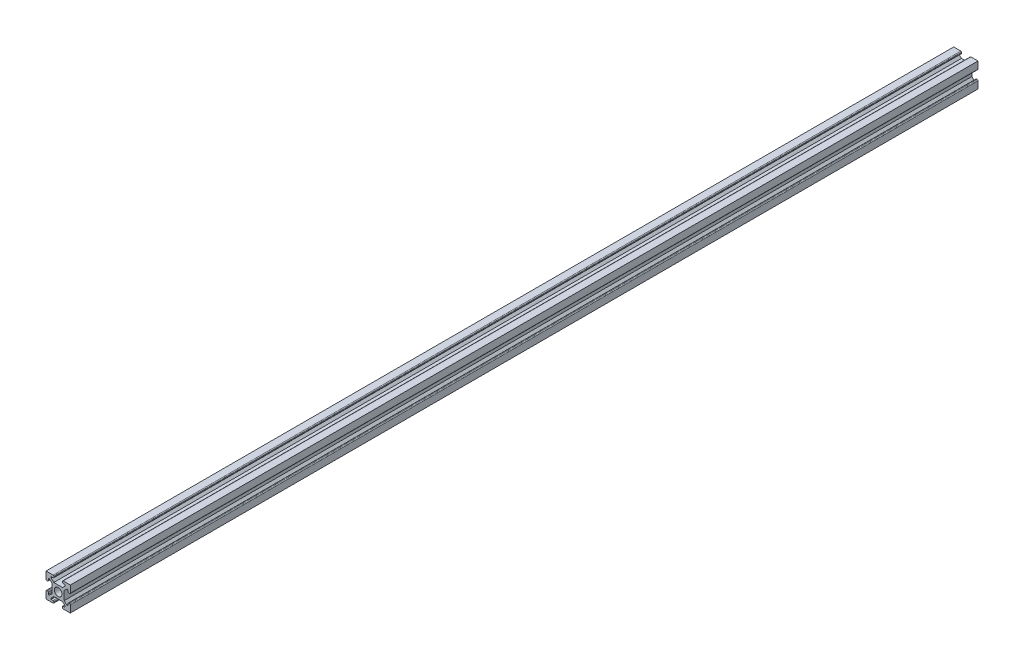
ISO-10303-21;
HEADER;
FILE_DESCRIPTION(('STEP AP214'),'2;1');
FILE_NAME('part.step','',(''),(''),'','','');
FILE_SCHEMA(('AUTOMOTIVE_DESIGN { 1 0 10303 214 1 1 1 1 }'));
ENDSEC;
DATA;
#1=APPLICATION_CONTEXT('core data for automotive mechanical design processes');
#2=APPLICATION_PROTOCOL_DEFINITION('international standard','automotive_design',2000,#1);
#3=PRODUCT_CONTEXT('',#1,'mechanical');
#4=PRODUCT('Part','Part','',(#3));
#5=PRODUCT_RELATED_PRODUCT_CATEGORY('part','',(#4));
#6=PRODUCT_DEFINITION_FORMATION('','',#4);
#7=PRODUCT_DEFINITION_CONTEXT('part definition',#1,'design');
#8=PRODUCT_DEFINITION('design','',#6,#7);
#9=PRODUCT_DEFINITION_SHAPE('','',#8);
#10=(LENGTH_UNIT() NAMED_UNIT(*) SI_UNIT(.MILLI.,.METRE.));
#11=(NAMED_UNIT(*) PLANE_ANGLE_UNIT() SI_UNIT($,.RADIAN.));
#12=(NAMED_UNIT(*) SI_UNIT($,.STERADIAN.) SOLID_ANGLE_UNIT());
#13=UNCERTAINTY_MEASURE_WITH_UNIT(LENGTH_MEASURE(1.E-05),#10,'distance_accuracy_value','');
#14=(GEOMETRIC_REPRESENTATION_CONTEXT(3) GLOBAL_UNCERTAINTY_ASSIGNED_CONTEXT((#13)) GLOBAL_UNIT_ASSIGNED_CONTEXT((#10,
#11,#12)) REPRESENTATION_CONTEXT('',''));
#15=CARTESIAN_POINT('',(0.,0.,0.));
#16=DIRECTION('',(0.,0.,1.));
#17=DIRECTION('',(1.,0.,0.));
#18=AXIS2_PLACEMENT_3D('',#15,#16,#17);
#19=CARTESIAN_POINT('',(10.033,0.,1500.000048));
#20=DIRECTION('',(1.,0.,0.));
#21=DIRECTION('',(0.,0.,-1.));
#22=AXIS2_PLACEMENT_3D('',#19,#20,#21);
#23=PLANE('',#22);
#24=DIRECTION('',(0.,-1.,0.));
#25=VECTOR('',#24,1.);
#26=CARTESIAN_POINT('',(10.033,0.,0.));
#27=LINE('',#26,#25);
#28=CARTESIAN_POINT('',(10.033,7.23121319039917,0.));
#29=VERTEX_POINT('',#28);
#30=CARTESIAN_POINT('',(10.033,-7.23121319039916,0.));
#31=VERTEX_POINT('',#30);
#32=EDGE_CURVE('E417',#29,#31,#27,.T.);
#33=ORIENTED_EDGE('',*,*,#32,.F.);
#34=DIRECTION('',(0.,0.,-1.));
#35=VECTOR('',#34,1.);
#36=CARTESIAN_POINT('',(10.033,7.23121319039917,1500.000048));
#37=LINE('',#36,#35);
#38=CARTESIAN_POINT('',(10.033,7.23121319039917,1500.000048));
#39=VERTEX_POINT('',#38);
#40=EDGE_CURVE('E411',#39,#29,#37,.T.);
#41=ORIENTED_EDGE('',*,*,#40,.F.);
#42=DIRECTION('',(0.,-1.,0.));
#43=VECTOR('',#42,1.);
#44=CARTESIAN_POINT('',(10.033,0.,1500.000048));
#45=LINE('',#44,#43);
#46=CARTESIAN_POINT('',(10.033,-7.23121319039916,1500.000048));
#47=VERTEX_POINT('',#46);
#48=EDGE_CURVE('E414',#39,#47,#45,.T.);
#49=ORIENTED_EDGE('',*,*,#48,.T.);
#50=DIRECTION('',(0.,0.,-1.));
#51=VECTOR('',#50,1.);
#52=CARTESIAN_POINT('',(10.033,-7.23121319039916,1500.000048));
#53=LINE('',#52,#51);
#54=EDGE_CURVE('E551',#47,#31,#53,.T.);
#55=ORIENTED_EDGE('',*,*,#54,.T.);
#56=EDGE_LOOP('',(#33,#41,#49,#55));
#57=FACE_BOUND('',#56,.T.);
#58=ADVANCED_FACE('F34',(#57),#23,.T.);
#59=CARTESIAN_POINT('',(1.40089340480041,-1.40089340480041,1500.000048));
#60=DIRECTION('',(-0.707106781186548,0.707106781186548,0.));
#61=DIRECTION('',(-0.707106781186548,-0.707106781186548,0.));
#62=AXIS2_PLACEMENT_3D('',#59,#60,#61);
#63=PLANE('',#62);
#64=DIRECTION('',(0.707106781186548,0.707106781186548,0.));
#65=VECTOR('',#64,1.);
#66=CARTESIAN_POINT('',(1.40089340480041,-1.40089340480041,0.));
#67=LINE('',#66,#65);
#68=CARTESIAN_POINT('',(14.478,11.6762131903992,0.));
#69=VERTEX_POINT('',#68);
#70=EDGE_CURVE('E553',#29,#69,#67,.T.);
#71=ORIENTED_EDGE('',*,*,#70,.T.);
#72=DIRECTION('',(0.,0.,-1.));
#73=VECTOR('',#72,1.);
#74=CARTESIAN_POINT('',(14.478,11.6762131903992,1500.000048));
#75=LINE('',#74,#73);
#76=CARTESIAN_POINT('',(14.478,11.6762131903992,1500.000048));
#77=VERTEX_POINT('',#76);
#78=EDGE_CURVE('E421',#77,#69,#75,.T.);
#79=ORIENTED_EDGE('',*,*,#78,.F.);
#80=DIRECTION('',(0.707106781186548,0.707106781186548,0.));
#81=VECTOR('',#80,1.);
#82=CARTESIAN_POINT('',(1.40089340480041,-1.40089340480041,1500.000048));
#83=LINE('',#82,#81);
#84=EDGE_CURVE('E424',#39,#77,#83,.T.);
#85=ORIENTED_EDGE('',*,*,#84,.F.);
#86=ORIENTED_EDGE('',*,*,#40,.T.);
#87=EDGE_LOOP('',(#71,#79,#85,#86));
#88=FACE_BOUND('',#87,.T.);
#89=ADVANCED_FACE('F425',(#88),#63,.F.);
#90=CARTESIAN_POINT('',(1.02528127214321E-13,11.6762131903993,1500.000048));
#91=DIRECTION('',(0.,1.,0.));
#92=DIRECTION('',(-1.,0.,0.));
#93=AXIS2_PLACEMENT_3D('',#90,#91,#92);
#94=PLANE('',#93);
#95=DIRECTION('',(1.,0.,0.));
#96=VECTOR('',#95,1.);
#97=CARTESIAN_POINT('',(1.02528127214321E-13,11.6762131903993,0.));
#98=LINE('',#97,#96);
#99=CARTESIAN_POINT('',(16.256,11.6762131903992,0.));
#100=VERTEX_POINT('',#99);
#101=EDGE_CURVE('E555',#69,#100,#98,.T.);
#102=ORIENTED_EDGE('',*,*,#101,.T.);
#103=DIRECTION('',(0.,0.,-1.));
#104=VECTOR('',#103,1.);
#105=CARTESIAN_POINT('',(16.256,11.6762131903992,1500.000048));
#106=LINE('',#105,#104);
#107=CARTESIAN_POINT('',(16.256,11.6762131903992,1500.000048));
#108=VERTEX_POINT('',#107);
#109=EDGE_CURVE('E727',#108,#100,#106,.T.);
#110=ORIENTED_EDGE('',*,*,#109,.F.);
#111=DIRECTION('',(1.,0.,0.));
#112=VECTOR('',#111,1.);
#113=CARTESIAN_POINT('',(1.02528127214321E-13,11.6762131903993,1500.000048));
#114=LINE('',#113,#112);
#115=EDGE_CURVE('E429',#77,#108,#114,.T.);
#116=ORIENTED_EDGE('',*,*,#115,.F.);
#117=ORIENTED_EDGE('',*,*,#78,.T.);
#118=EDGE_LOOP('',(#102,#110,#116,#117));
#119=FACE_BOUND('',#118,.T.);
#120=ADVANCED_FACE('F891',(#119),#94,.F.);
#121=CARTESIAN_POINT('',(16.256,0.,1500.000048));
#122=DIRECTION('',(-1.,0.,0.));
#123=DIRECTION('',(0.,-1.,0.));
#124=AXIS2_PLACEMENT_3D('',#121,#122,#123);
#125=PLANE('',#124);
#126=DIRECTION('',(0.,1.,0.));
#127=VECTOR('',#126,1.);
#128=CARTESIAN_POINT('',(16.256,0.,0.));
#129=LINE('',#128,#127);
#130=CARTESIAN_POINT('',(16.256,8.37421319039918,0.));
#131=VERTEX_POINT('',#130);
#132=EDGE_CURVE('E558',#131,#100,#129,.T.);
#133=ORIENTED_EDGE('',*,*,#132,.F.);
#134=DIRECTION('',(0.,0.,-1.));
#135=VECTOR('',#134,1.);
#136=CARTESIAN_POINT('',(16.256,8.37421319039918,1500.000048));
#137=LINE('',#136,#135);
#138=CARTESIAN_POINT('',(16.256,8.37421319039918,1500.000048));
#139=VERTEX_POINT('',#138);
#140=EDGE_CURVE('E801',#131,#139,#137,.F.);
#141=ORIENTED_EDGE('',*,*,#140,.T.);
#142=DIRECTION('',(0.,1.,0.));
#143=VECTOR('',#142,1.);
#144=CARTESIAN_POINT('',(16.256,0.,1500.000048));
#145=LINE('',#144,#143);
#146=EDGE_CURVE('E444',#139,#108,#145,.T.);
#147=ORIENTED_EDGE('',*,*,#146,.T.);
#148=ORIENTED_EDGE('',*,*,#109,.T.);
#149=EDGE_LOOP('',(#133,#141,#147,#148));
#150=FACE_BOUND('',#149,.T.);
#151=ADVANCED_FACE('F1473',(#150),#125,.T.);
#152=CARTESIAN_POINT('',(0.,7.10421319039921,1500.000048));
#153=DIRECTION('',(0.,-1.,0.));
#154=DIRECTION('',(1.,0.,0.));
#155=AXIS2_PLACEMENT_3D('',#152,#153,#154);
#156=PLANE('',#155);
#157=DIRECTION('',(-1.,0.,0.));
#158=VECTOR('',#157,1.);
#159=CARTESIAN_POINT('',(0.,7.10421319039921,0.));
#160=LINE('',#159,#158);
#161=CARTESIAN_POINT('',(18.796,7.10421319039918,0.));
#162=VERTEX_POINT('',#161);
#163=CARTESIAN_POINT('',(17.526,7.10421319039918,0.));
#164=VERTEX_POINT('',#163);
#165=EDGE_CURVE('E560',#162,#164,#160,.T.);
#166=ORIENTED_EDGE('',*,*,#165,.F.);
#167=DIRECTION('',(0.,0.,-1.));
#168=VECTOR('',#167,1.);
#169=CARTESIAN_POINT('',(18.796,7.10421319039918,1500.000048));
#170=LINE('',#169,#168);
#171=CARTESIAN_POINT('',(18.796,7.10421319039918,1500.000048));
#172=VERTEX_POINT('',#171);
#173=EDGE_CURVE('E768',#162,#172,#170,.F.);
#174=ORIENTED_EDGE('',*,*,#173,.T.);
#175=DIRECTION('',(-1.,0.,0.));
#176=VECTOR('',#175,1.);
#177=CARTESIAN_POINT('',(0.,7.10421319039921,1500.000048));
#178=LINE('',#177,#176);
#179=CARTESIAN_POINT('',(17.526,7.10421319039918,1500.000048));
#180=VERTEX_POINT('',#179);
#181=EDGE_CURVE('E446',#172,#180,#178,.T.);
#182=ORIENTED_EDGE('',*,*,#181,.T.);
#183=DIRECTION('',(0.,0.,-1.));
#184=VECTOR('',#183,1.);
#185=CARTESIAN_POINT('',(17.526,7.10421319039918,1500.000048));
#186=LINE('',#185,#184);
#187=EDGE_CURVE('E765',#180,#164,#186,.T.);
#188=ORIENTED_EDGE('',*,*,#187,.T.);
#189=EDGE_LOOP('',(#166,#174,#182,#188));
#190=FACE_BOUND('',#189,.T.);
#191=ADVANCED_FACE('F902',(#190),#156,.T.);
#192=CARTESIAN_POINT('',(20.066,0.,1500.000048));
#193=DIRECTION('',(1.,0.,0.));
#194=DIRECTION('',(0.,0.,-1.));
#195=AXIS2_PLACEMENT_3D('',#192,#193,#194);
#196=PLANE('',#195);
#197=DIRECTION('',(0.,-1.,0.));
#198=VECTOR('',#197,1.);
#199=CARTESIAN_POINT('',(20.066,0.,1500.000048));
#200=LINE('',#199,#198);
#201=CARTESIAN_POINT('',(20.066,20.066,1500.000048));
#202=VERTEX_POINT('',#201);
#203=CARTESIAN_POINT('',(20.066,8.37421319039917,1500.000048));
#204=VERTEX_POINT('',#203);
#205=EDGE_CURVE('E449',#202,#204,#200,.T.);
#206=ORIENTED_EDGE('',*,*,#205,.T.);
#207=DIRECTION('',(0.,0.,-1.));
#208=VECTOR('',#207,1.);
#209=CARTESIAN_POINT('',(20.066,8.37421319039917,1500.000048));
#210=LINE('',#209,#208);
#211=CARTESIAN_POINT('',(20.066,8.37421319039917,0.));
#212=VERTEX_POINT('',#211);
#213=EDGE_CURVE('E420',#204,#212,#210,.T.);
#214=ORIENTED_EDGE('',*,*,#213,.T.);
#215=DIRECTION('',(0.,-1.,0.));
#216=VECTOR('',#215,1.);
#217=CARTESIAN_POINT('',(20.066,0.,0.));
#218=LINE('',#217,#216);
#219=CARTESIAN_POINT('',(20.066,20.066,0.));
#220=VERTEX_POINT('',#219);
#221=EDGE_CURVE('E563',#220,#212,#218,.T.);
#222=ORIENTED_EDGE('',*,*,#221,.F.);
#223=DIRECTION('',(0.,0.,-1.));
#224=VECTOR('',#223,1.);
#225=CARTESIAN_POINT('',(20.066,20.066,1500.000048));
#226=LINE('',#225,#224);
#227=EDGE_CURVE('E724',#202,#220,#226,.T.);
#228=ORIENTED_EDGE('',*,*,#227,.F.);
#229=EDGE_LOOP('',(#206,#214,#222,#228));
#230=FACE_BOUND('',#229,.T.);
#231=ADVANCED_FACE('F911',(#230),#196,.T.);
#232=CARTESIAN_POINT('',(0.,20.066,1500.000048));
#233=DIRECTION('',(0.,1.,0.));
#234=DIRECTION('',(0.,0.,1.));
#235=AXIS2_PLACEMENT_3D('',#232,#233,#234);
#236=PLANE('',#235);
#237=DIRECTION('',(1.,0.,0.));
#238=VECTOR('',#237,1.);
#239=CARTESIAN_POINT('',(0.,20.066,0.));
#240=LINE('',#239,#238);
#241=CARTESIAN_POINT('',(8.37421319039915,20.066,0.));
#242=VERTEX_POINT('',#241);
#243=EDGE_CURVE('E566',#242,#220,#240,.T.);
#244=ORIENTED_EDGE('',*,*,#243,.F.);
#245=DIRECTION('',(0.,0.,-1.));
#246=VECTOR('',#245,1.);
#247=CARTESIAN_POINT('',(8.37421319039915,20.066,1500.000048));
#248=LINE('',#247,#246);
#249=CARTESIAN_POINT('',(8.37421319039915,20.066,1500.000048));
#250=VERTEX_POINT('',#249);
#251=EDGE_CURVE('E808',#242,#250,#248,.F.);
#252=ORIENTED_EDGE('',*,*,#251,.T.);
#253=DIRECTION('',(1.,0.,0.));
#254=VECTOR('',#253,1.);
#255=CARTESIAN_POINT('',(0.,20.066,1500.000048));
#256=LINE('',#255,#254);
#257=EDGE_CURVE('E452',#250,#202,#256,.T.);
#258=ORIENTED_EDGE('',*,*,#257,.T.);
#259=ORIENTED_EDGE('',*,*,#227,.T.);
#260=EDGE_LOOP('',(#244,#252,#258,#259));
#261=FACE_BOUND('',#260,.T.);
#262=ADVANCED_FACE('F1448',(#261),#236,.T.);
#263=CARTESIAN_POINT('',(7.10421319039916,0.,1500.000048));
#264=DIRECTION('',(1.,0.,0.));
#265=DIRECTION('',(0.,1.,0.));
#266=AXIS2_PLACEMENT_3D('',#263,#264,#265);
#267=PLANE('',#266);
#268=DIRECTION('',(0.,-1.,0.));
#269=VECTOR('',#268,1.);
#270=CARTESIAN_POINT('',(7.10421319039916,0.,1500.000048));
#271=LINE('',#270,#269);
#272=CARTESIAN_POINT('',(7.10421319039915,18.796,1500.000048));
#273=VERTEX_POINT('',#272);
#274=CARTESIAN_POINT('',(7.10421319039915,17.526,1500.000048));
#275=VERTEX_POINT('',#274);
#276=EDGE_CURVE('E454',#273,#275,#271,.T.);
#277=ORIENTED_EDGE('',*,*,#276,.F.);
#278=DIRECTION('',(0.,0.,-1.));
#279=VECTOR('',#278,1.);
#280=CARTESIAN_POINT('',(7.10421319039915,18.796,0.));
#281=LINE('',#280,#279);
#282=CARTESIAN_POINT('',(7.10421319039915,18.796,0.));
#283=VERTEX_POINT('',#282);
#284=EDGE_CURVE('E805',#273,#283,#281,.T.);
#285=ORIENTED_EDGE('',*,*,#284,.T.);
#286=DIRECTION('',(0.,-1.,0.));
#287=VECTOR('',#286,1.);
#288=CARTESIAN_POINT('',(7.10421319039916,0.,0.));
#289=LINE('',#288,#287);
#290=CARTESIAN_POINT('',(7.10421319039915,17.526,0.));
#291=VERTEX_POINT('',#290);
#292=EDGE_CURVE('E568',#283,#291,#289,.T.);
#293=ORIENTED_EDGE('',*,*,#292,.T.);
#294=DIRECTION('',(0.,0.,-1.));
#295=VECTOR('',#294,1.);
#296=CARTESIAN_POINT('',(7.10421319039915,17.526,1500.000048));
#297=LINE('',#296,#295);
#298=EDGE_CURVE('E803',#291,#275,#297,.F.);
#299=ORIENTED_EDGE('',*,*,#298,.T.);
#300=EDGE_LOOP('',(#277,#285,#293,#299));
#301=FACE_BOUND('',#300,.T.);
#302=ADVANCED_FACE('F924',(#301),#267,.F.);
#303=CARTESIAN_POINT('',(0.,16.256,1500.000048));
#304=DIRECTION('',(0.,1.,0.));
#305=DIRECTION('',(0.,0.,1.));
#306=AXIS2_PLACEMENT_3D('',#303,#304,#305);
#307=PLANE('',#306);
#308=DIRECTION('',(1.,0.,0.));
#309=VECTOR('',#308,1.);
#310=CARTESIAN_POINT('',(0.,16.256,1500.000048));
#311=LINE('',#310,#309);
#312=CARTESIAN_POINT('',(8.37421319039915,16.256,1500.000048));
#313=VERTEX_POINT('',#312);
#314=CARTESIAN_POINT('',(11.6762131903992,16.256,1500.000048));
#315=VERTEX_POINT('',#314);
#316=EDGE_CURVE('E457',#313,#315,#311,.T.);
#317=ORIENTED_EDGE('',*,*,#316,.F.);
#318=DIRECTION('',(0.,0.,-1.));
#319=VECTOR('',#318,1.);
#320=CARTESIAN_POINT('',(8.37421319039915,16.256,1500.000048));
#321=LINE('',#320,#319);
#322=CARTESIAN_POINT('',(8.37421319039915,16.256,0.));
#323=VERTEX_POINT('',#322);
#324=EDGE_CURVE('E810',#313,#323,#321,.T.);
#325=ORIENTED_EDGE('',*,*,#324,.T.);
#326=DIRECTION('',(1.,0.,0.));
#327=VECTOR('',#326,1.);
#328=CARTESIAN_POINT('',(0.,16.256,0.));
#329=LINE('',#328,#327);
#330=CARTESIAN_POINT('',(11.6762131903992,16.256,0.));
#331=VERTEX_POINT('',#330);
#332=EDGE_CURVE('E571',#323,#331,#329,.T.);
#333=ORIENTED_EDGE('',*,*,#332,.T.);
#334=DIRECTION('',(0.,0.,-1.));
#335=VECTOR('',#334,1.);
#336=CARTESIAN_POINT('',(11.6762131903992,16.256,1500.000048));
#337=LINE('',#336,#335);
#338=EDGE_CURVE('E721',#315,#331,#337,.T.);
#339=ORIENTED_EDGE('',*,*,#338,.F.);
#340=EDGE_LOOP('',(#317,#325,#333,#339));
#341=FACE_BOUND('',#340,.T.);
#342=ADVANCED_FACE('F934',(#341),#307,.F.);
#343=CARTESIAN_POINT('',(11.6762131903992,0.,1500.000048));
#344=DIRECTION('',(-1.,0.,0.));
#345=DIRECTION('',(0.,0.,1.));
#346=AXIS2_PLACEMENT_3D('',#343,#344,#345);
#347=PLANE('',#346);
#348=DIRECTION('',(0.,1.,0.));
#349=VECTOR('',#348,1.);
#350=CARTESIAN_POINT('',(11.6762131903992,0.,0.));
#351=LINE('',#350,#349);
#352=CARTESIAN_POINT('',(11.6762131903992,14.478,0.));
#353=VERTEX_POINT('',#352);
#354=EDGE_CURVE('E573',#353,#331,#351,.T.);
#355=ORIENTED_EDGE('',*,*,#354,.F.);
#356=DIRECTION('',(0.,0.,-1.));
#357=VECTOR('',#356,1.);
#358=CARTESIAN_POINT('',(11.6762131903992,14.478,1500.000048));
#359=LINE('',#358,#357);
#360=CARTESIAN_POINT('',(11.6762131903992,14.478,1500.000048));
#361=VERTEX_POINT('',#360);
#362=EDGE_CURVE('E719',#361,#353,#359,.T.);
#363=ORIENTED_EDGE('',*,*,#362,.F.);
#364=DIRECTION('',(0.,1.,0.));
#365=VECTOR('',#364,1.);
#366=CARTESIAN_POINT('',(11.6762131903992,0.,1500.000048));
#367=LINE('',#366,#365);
#368=EDGE_CURVE('E459',#361,#315,#367,.T.);
#369=ORIENTED_EDGE('',*,*,#368,.T.);
#370=ORIENTED_EDGE('',*,*,#338,.T.);
#371=EDGE_LOOP('',(#355,#363,#369,#370));
#372=FACE_BOUND('',#371,.T.);
#373=ADVANCED_FACE('F1437',(#372),#347,.T.);
#374=CARTESIAN_POINT('',(-1.40089340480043,1.40089340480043,1500.000048));
#375=DIRECTION('',(-0.707106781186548,0.707106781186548,0.));
#376=DIRECTION('',(-0.707106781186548,-0.707106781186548,0.));
#377=AXIS2_PLACEMENT_3D('',#374,#375,#376);
#378=PLANE('',#377);
#379=DIRECTION('',(0.707106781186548,0.707106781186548,0.));
#380=VECTOR('',#379,1.);
#381=CARTESIAN_POINT('',(-1.40089340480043,1.40089340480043,0.));
#382=LINE('',#381,#380);
#383=CARTESIAN_POINT('',(7.23121319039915,10.033,0.));
#384=VERTEX_POINT('',#383);
#385=EDGE_CURVE('E576',#384,#353,#382,.T.);
#386=ORIENTED_EDGE('',*,*,#385,.F.);
#387=DIRECTION('',(0.,0.,-1.));
#388=VECTOR('',#387,1.);
#389=CARTESIAN_POINT('',(7.23121319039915,10.033,1500.000048));
#390=LINE('',#389,#388);
#391=CARTESIAN_POINT('',(7.23121319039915,10.033,1500.000048));
#392=VERTEX_POINT('',#391);
#393=EDGE_CURVE('E717',#392,#384,#390,.T.);
#394=ORIENTED_EDGE('',*,*,#393,.F.);
#395=DIRECTION('',(0.707106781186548,0.707106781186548,0.));
#396=VECTOR('',#395,1.);
#397=CARTESIAN_POINT('',(-1.40089340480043,1.40089340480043,1500.000048));
#398=LINE('',#397,#396);
#399=EDGE_CURVE('E462',#392,#361,#398,.T.);
#400=ORIENTED_EDGE('',*,*,#399,.T.);
#401=ORIENTED_EDGE('',*,*,#362,.T.);
#402=EDGE_LOOP('',(#386,#394,#400,#401));
#403=FACE_BOUND('',#402,.T.);
#404=ADVANCED_FACE('F942',(#403),#378,.T.);
#405=CARTESIAN_POINT('',(0.,10.033,1500.000048));
#406=DIRECTION('',(0.,1.,0.));
#407=DIRECTION('',(0.,0.,1.));
#408=AXIS2_PLACEMENT_3D('',#405,#406,#407);
#409=PLANE('',#408);
#410=DIRECTION('',(1.,0.,0.));
#411=VECTOR('',#410,1.);
#412=CARTESIAN_POINT('',(0.,10.033,0.));
#413=LINE('',#412,#411);
#414=CARTESIAN_POINT('',(-7.23121319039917,10.033,0.));
#415=VERTEX_POINT('',#414);
#416=EDGE_CURVE('E579',#415,#384,#413,.T.);
#417=ORIENTED_EDGE('',*,*,#416,.F.);
#418=DIRECTION('',(0.,0.,-1.));
#419=VECTOR('',#418,1.);
#420=CARTESIAN_POINT('',(-7.23121319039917,10.033,1500.000048));
#421=LINE('',#420,#419);
#422=CARTESIAN_POINT('',(-7.23121319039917,10.033,1500.000048));
#423=VERTEX_POINT('',#422);
#424=EDGE_CURVE('E715',#423,#415,#421,.T.);
#425=ORIENTED_EDGE('',*,*,#424,.F.);
#426=DIRECTION('',(1.,0.,0.));
#427=VECTOR('',#426,1.);
#428=CARTESIAN_POINT('',(0.,10.033,1500.000048));
#429=LINE('',#428,#427);
#430=EDGE_CURVE('E465',#423,#392,#429,.T.);
#431=ORIENTED_EDGE('',*,*,#430,.T.);
#432=ORIENTED_EDGE('',*,*,#393,.T.);
#433=EDGE_LOOP('',(#417,#425,#431,#432));
#434=FACE_BOUND('',#433,.T.);
#435=ADVANCED_FACE('F946',(#434),#409,.T.);
#436=CARTESIAN_POINT('',(1.40089340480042,1.40089340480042,1500.000048));
#437=DIRECTION('',(-0.707106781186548,-0.707106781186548,0.));
#438=DIRECTION('',(0.707106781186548,-0.707106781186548,0.));
#439=AXIS2_PLACEMENT_3D('',#436,#437,#438);
#440=PLANE('',#439);
#441=DIRECTION('',(-0.707106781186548,0.707106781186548,0.));
#442=VECTOR('',#441,1.);
#443=CARTESIAN_POINT('',(1.40089340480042,1.40089340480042,0.));
#444=LINE('',#443,#442);
#445=CARTESIAN_POINT('',(-11.6762131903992,14.478,0.));
#446=VERTEX_POINT('',#445);
#447=EDGE_CURVE('E582',#415,#446,#444,.T.);
#448=ORIENTED_EDGE('',*,*,#447,.T.);
#449=DIRECTION('',(0.,0.,-1.));
#450=VECTOR('',#449,1.);
#451=CARTESIAN_POINT('',(-11.6762131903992,14.478,1500.000048));
#452=LINE('',#451,#450);
#453=CARTESIAN_POINT('',(-11.6762131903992,14.478,1500.000048));
#454=VERTEX_POINT('',#453);
#455=EDGE_CURVE('E712',#454,#446,#452,.T.);
#456=ORIENTED_EDGE('',*,*,#455,.F.);
#457=DIRECTION('',(-0.707106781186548,0.707106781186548,0.));
#458=VECTOR('',#457,1.);
#459=CARTESIAN_POINT('',(1.40089340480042,1.40089340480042,1500.000048));
#460=LINE('',#459,#458);
#461=EDGE_CURVE('E468',#423,#454,#460,.T.);
#462=ORIENTED_EDGE('',*,*,#461,.F.);
#463=ORIENTED_EDGE('',*,*,#424,.T.);
#464=EDGE_LOOP('',(#448,#456,#462,#463));
#465=FACE_BOUND('',#464,.T.);
#466=ADVANCED_FACE('F953',(#465),#440,.F.);
#467=CARTESIAN_POINT('',(-11.6762131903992,0.,1500.000048));
#468=DIRECTION('',(-1.,0.,0.));
#469=DIRECTION('',(0.,0.,1.));
#470=AXIS2_PLACEMENT_3D('',#467,#468,#469);
#471=PLANE('',#470);
#472=DIRECTION('',(0.,1.,0.));
#473=VECTOR('',#472,1.);
#474=CARTESIAN_POINT('',(-11.6762131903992,0.,0.));
#475=LINE('',#474,#473);
#476=CARTESIAN_POINT('',(-11.6762131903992,16.256,0.));
#477=VERTEX_POINT('',#476);
#478=EDGE_CURVE('E584',#446,#477,#475,.T.);
#479=ORIENTED_EDGE('',*,*,#478,.T.);
#480=DIRECTION('',(0.,0.,-1.));
#481=VECTOR('',#480,1.);
#482=CARTESIAN_POINT('',(-11.6762131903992,16.256,1500.000048));
#483=LINE('',#482,#481);
#484=CARTESIAN_POINT('',(-11.6762131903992,16.256,1500.000048));
#485=VERTEX_POINT('',#484);
#486=EDGE_CURVE('E709',#485,#477,#483,.T.);
#487=ORIENTED_EDGE('',*,*,#486,.F.);
#488=DIRECTION('',(0.,1.,0.));
#489=VECTOR('',#488,1.);
#490=CARTESIAN_POINT('',(-11.6762131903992,0.,1500.000048));
#491=LINE('',#490,#489);
#492=EDGE_CURVE('E470',#454,#485,#491,.T.);
#493=ORIENTED_EDGE('',*,*,#492,.F.);
#494=ORIENTED_EDGE('',*,*,#455,.T.);
#495=EDGE_LOOP('',(#479,#487,#493,#494));
#496=FACE_BOUND('',#495,.T.);
#497=ADVANCED_FACE('F957',(#496),#471,.F.);
#498=CARTESIAN_POINT('',(0.,16.256,1500.000048));
#499=DIRECTION('',(0.,-1.,0.));
#500=DIRECTION('',(0.,0.,-1.));
#501=AXIS2_PLACEMENT_3D('',#498,#499,#500);
#502=PLANE('',#501);
#503=DIRECTION('',(-1.,0.,0.));
#504=VECTOR('',#503,1.);
#505=CARTESIAN_POINT('',(0.,16.256,0.));
#506=LINE('',#505,#504);
#507=CARTESIAN_POINT('',(-8.37421319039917,16.256,0.));
#508=VERTEX_POINT('',#507);
#509=EDGE_CURVE('E587',#508,#477,#506,.T.);
#510=ORIENTED_EDGE('',*,*,#509,.F.);
#511=DIRECTION('',(0.,0.,-1.));
#512=VECTOR('',#511,1.);
#513=CARTESIAN_POINT('',(-8.37421319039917,16.256,1500.000048));
#514=LINE('',#513,#512);
#515=CARTESIAN_POINT('',(-8.37421319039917,16.256,1500.000048));
#516=VERTEX_POINT('',#515);
#517=EDGE_CURVE('E818',#508,#516,#514,.F.);
#518=ORIENTED_EDGE('',*,*,#517,.T.);
#519=DIRECTION('',(-1.,0.,0.));
#520=VECTOR('',#519,1.);
#521=CARTESIAN_POINT('',(0.,16.256,1500.000048));
#522=LINE('',#521,#520);
#523=EDGE_CURVE('E473',#516,#485,#522,.T.);
#524=ORIENTED_EDGE('',*,*,#523,.T.);
#525=ORIENTED_EDGE('',*,*,#486,.T.);
#526=EDGE_LOOP('',(#510,#518,#524,#525));
#527=FACE_BOUND('',#526,.T.);
#528=ADVANCED_FACE('F960',(#527),#502,.T.);
#529=CARTESIAN_POINT('',(-7.10421319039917,0.,1500.000048));
#530=DIRECTION('',(1.,0.,0.));
#531=DIRECTION('',(0.,1.,0.));
#532=AXIS2_PLACEMENT_3D('',#529,#530,#531);
#533=PLANE('',#532);
#534=DIRECTION('',(0.,-1.,0.));
#535=VECTOR('',#534,1.);
#536=CARTESIAN_POINT('',(-7.10421319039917,0.,1500.000048));
#537=LINE('',#536,#535);
#538=CARTESIAN_POINT('',(-7.10421319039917,18.796,1500.000048));
#539=VERTEX_POINT('',#538);
#540=CARTESIAN_POINT('',(-7.10421319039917,17.526,1500.000048));
#541=VERTEX_POINT('',#540);
#542=EDGE_CURVE('E475',#539,#541,#537,.T.);
#543=ORIENTED_EDGE('',*,*,#542,.T.);
#544=DIRECTION('',(0.,0.,-1.));
#545=VECTOR('',#544,1.);
#546=CARTESIAN_POINT('',(-7.10421319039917,17.526,1500.000048));
#547=LINE('',#546,#545);
#548=CARTESIAN_POINT('',(-7.10421319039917,17.526,0.));
#549=VERTEX_POINT('',#548);
#550=EDGE_CURVE('E815',#541,#549,#547,.T.);
#551=ORIENTED_EDGE('',*,*,#550,.T.);
#552=DIRECTION('',(0.,-1.,0.));
#553=VECTOR('',#552,1.);
#554=CARTESIAN_POINT('',(-7.10421319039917,0.,0.));
#555=LINE('',#554,#553);
#556=CARTESIAN_POINT('',(-7.10421319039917,18.796,0.));
#557=VERTEX_POINT('',#556);
#558=EDGE_CURVE('E589',#557,#549,#555,.T.);
#559=ORIENTED_EDGE('',*,*,#558,.F.);
#560=DIRECTION('',(0.,0.,-1.));
#561=VECTOR('',#560,1.);
#562=CARTESIAN_POINT('',(-7.10421319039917,18.796,1500.000048));
#563=LINE('',#562,#561);
#564=EDGE_CURVE('E813',#557,#539,#563,.F.);
#565=ORIENTED_EDGE('',*,*,#564,.T.);
#566=EDGE_LOOP('',(#543,#551,#559,#565));
#567=FACE_BOUND('',#566,.T.);
#568=ADVANCED_FACE('F969',(#567),#533,.T.);
#569=CARTESIAN_POINT('',(0.,20.066,1500.000048));
#570=DIRECTION('',(0.,1.,0.));
#571=DIRECTION('',(0.,0.,1.));
#572=AXIS2_PLACEMENT_3D('',#569,#570,#571);
#573=PLANE('',#572);
#574=DIRECTION('',(1.,0.,0.));
#575=VECTOR('',#574,1.);
#576=CARTESIAN_POINT('',(0.,20.066,1500.000048));
#577=LINE('',#576,#575);
#578=CARTESIAN_POINT('',(-20.066,20.066,1500.000048));
#579=VERTEX_POINT('',#578);
#580=CARTESIAN_POINT('',(-8.37421319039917,20.066,1500.000048));
#581=VERTEX_POINT('',#580);
#582=EDGE_CURVE('E478',#579,#581,#577,.T.);
#583=ORIENTED_EDGE('',*,*,#582,.T.);
#584=DIRECTION('',(0.,0.,-1.));
#585=VECTOR('',#584,1.);
#586=CARTESIAN_POINT('',(-8.37421319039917,20.066,1500.000048));
#587=LINE('',#586,#585);
#588=CARTESIAN_POINT('',(-8.37421319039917,20.066,0.));
#589=VERTEX_POINT('',#588);
#590=EDGE_CURVE('E820',#581,#589,#587,.T.);
#591=ORIENTED_EDGE('',*,*,#590,.T.);
#592=DIRECTION('',(1.,0.,0.));
#593=VECTOR('',#592,1.);
#594=CARTESIAN_POINT('',(0.,20.066,0.));
#595=LINE('',#594,#593);
#596=CARTESIAN_POINT('',(-20.066,20.066,0.));
#597=VERTEX_POINT('',#596);
#598=EDGE_CURVE('E592',#597,#589,#595,.T.);
#599=ORIENTED_EDGE('',*,*,#598,.F.);
#600=DIRECTION('',(0.,0.,-1.));
#601=VECTOR('',#600,1.);
#602=CARTESIAN_POINT('',(-20.066,20.066,1500.000048));
#603=LINE('',#602,#601);
#604=EDGE_CURVE('E707',#579,#597,#603,.T.);
#605=ORIENTED_EDGE('',*,*,#604,.F.);
#606=EDGE_LOOP('',(#583,#591,#599,#605));
#607=FACE_BOUND('',#606,.T.);
#608=ADVANCED_FACE('F978',(#607),#573,.T.);
#609=CARTESIAN_POINT('',(-20.066,0.,1500.000048));
#610=DIRECTION('',(1.,0.,0.));
#611=DIRECTION('',(0.,0.,-1.));
#612=AXIS2_PLACEMENT_3D('',#609,#610,#611);
#613=PLANE('',#612);
#614=DIRECTION('',(0.,-1.,0.));
#615=VECTOR('',#614,1.);
#616=CARTESIAN_POINT('',(-20.066,0.,0.));
#617=LINE('',#616,#615);
#618=CARTESIAN_POINT('',(-20.066,8.37421319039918,0.));
#619=VERTEX_POINT('',#618);
#620=EDGE_CURVE('E595',#597,#619,#617,.T.);
#621=ORIENTED_EDGE('',*,*,#620,.T.);
#622=DIRECTION('',(0.,0.,-1.));
#623=VECTOR('',#622,1.);
#624=CARTESIAN_POINT('',(-20.066,8.37421319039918,1500.000048));
#625=LINE('',#624,#623);
#626=CARTESIAN_POINT('',(-20.066,8.37421319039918,1500.000048));
#627=VERTEX_POINT('',#626);
#628=EDGE_CURVE('E831',#619,#627,#625,.F.);
#629=ORIENTED_EDGE('',*,*,#628,.T.);
#630=DIRECTION('',(0.,-1.,0.));
#631=VECTOR('',#630,1.);
#632=CARTESIAN_POINT('',(-20.066,0.,1500.000048));
#633=LINE('',#632,#631);
#634=EDGE_CURVE('E481',#579,#627,#633,.T.);
#635=ORIENTED_EDGE('',*,*,#634,.F.);
#636=ORIENTED_EDGE('',*,*,#604,.T.);
#637=EDGE_LOOP('',(#621,#629,#635,#636));
#638=FACE_BOUND('',#637,.T.);
#639=ADVANCED_FACE('F1394',(#638),#613,.F.);
#640=CARTESIAN_POINT('',(0.,7.10421319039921,1500.000048));
#641=DIRECTION('',(0.,1.,0.));
#642=DIRECTION('',(-1.,0.,0.));
#643=AXIS2_PLACEMENT_3D('',#640,#641,#642);
#644=PLANE('',#643);
#645=DIRECTION('',(1.,0.,0.));
#646=VECTOR('',#645,1.);
#647=CARTESIAN_POINT('',(0.,7.10421319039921,0.));
#648=LINE('',#647,#646);
#649=CARTESIAN_POINT('',(-18.796,7.10421319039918,0.));
#650=VERTEX_POINT('',#649);
#651=CARTESIAN_POINT('',(-17.526,7.10421319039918,0.));
#652=VERTEX_POINT('',#651);
#653=EDGE_CURVE('E598',#650,#652,#648,.T.);
#654=ORIENTED_EDGE('',*,*,#653,.T.);
#655=DIRECTION('',(0.,0.,-1.));
#656=VECTOR('',#655,1.);
#657=CARTESIAN_POINT('',(-17.526,7.10421319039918,1500.000048));
#658=LINE('',#657,#656);
#659=CARTESIAN_POINT('',(-17.526,7.10421319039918,1500.000048));
#660=VERTEX_POINT('',#659);
#661=EDGE_CURVE('E829',#652,#660,#658,.F.);
#662=ORIENTED_EDGE('',*,*,#661,.T.);
#663=DIRECTION('',(1.,0.,0.));
#664=VECTOR('',#663,1.);
#665=CARTESIAN_POINT('',(0.,7.10421319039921,1500.000048));
#666=LINE('',#665,#664);
#667=CARTESIAN_POINT('',(-18.796,7.10421319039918,1500.000048));
#668=VERTEX_POINT('',#667);
#669=EDGE_CURVE('E484',#668,#660,#666,.T.);
#670=ORIENTED_EDGE('',*,*,#669,.F.);
#671=DIRECTION('',(0.,0.,-1.));
#672=VECTOR('',#671,1.);
#673=CARTESIAN_POINT('',(-18.796,7.10421319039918,1500.000048));
#674=LINE('',#673,#672);
#675=EDGE_CURVE('E826',#668,#650,#674,.T.);
#676=ORIENTED_EDGE('',*,*,#675,.T.);
#677=EDGE_LOOP('',(#654,#662,#670,#676));
#678=FACE_BOUND('',#677,.T.);
#679=ADVANCED_FACE('F990',(#678),#644,.F.);
#680=CARTESIAN_POINT('',(-16.256,0.,1500.000048));
#681=DIRECTION('',(-1.,0.,0.));
#682=DIRECTION('',(0.,-1.,0.));
#683=AXIS2_PLACEMENT_3D('',#680,#681,#682);
#684=PLANE('',#683);
#685=DIRECTION('',(0.,1.,0.));
#686=VECTOR('',#685,1.);
#687=CARTESIAN_POINT('',(-16.256,0.,1500.000048));
#688=LINE('',#687,#686);
#689=CARTESIAN_POINT('',(-16.256,8.37421319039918,1500.000048));
#690=VERTEX_POINT('',#689);
#691=CARTESIAN_POINT('',(-16.256,11.6762131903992,1500.000048));
#692=VERTEX_POINT('',#691);
#693=EDGE_CURVE('E487',#690,#692,#688,.T.);
#694=ORIENTED_EDGE('',*,*,#693,.F.);
#695=DIRECTION('',(0.,0.,-1.));
#696=VECTOR('',#695,1.);
#697=CARTESIAN_POINT('',(-16.256,8.37421319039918,1500.000048));
#698=LINE('',#697,#696);
#699=CARTESIAN_POINT('',(-16.256,8.37421319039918,0.));
#700=VERTEX_POINT('',#699);
#701=EDGE_CURVE('E823',#690,#700,#698,.T.);
#702=ORIENTED_EDGE('',*,*,#701,.T.);
#703=DIRECTION('',(0.,1.,0.));
#704=VECTOR('',#703,1.);
#705=CARTESIAN_POINT('',(-16.256,0.,0.));
#706=LINE('',#705,#704);
#707=CARTESIAN_POINT('',(-16.256,11.6762131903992,0.));
#708=VERTEX_POINT('',#707);
#709=EDGE_CURVE('E601',#700,#708,#706,.T.);
#710=ORIENTED_EDGE('',*,*,#709,.T.);
#711=DIRECTION('',(0.,0.,-1.));
#712=VECTOR('',#711,1.);
#713=CARTESIAN_POINT('',(-16.256,11.6762131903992,1500.000048));
#714=LINE('',#713,#712);
#715=EDGE_CURVE('E704',#692,#708,#714,.T.);
#716=ORIENTED_EDGE('',*,*,#715,.F.);
#717=EDGE_LOOP('',(#694,#702,#710,#716));
#718=FACE_BOUND('',#717,.T.);
#719=ADVANCED_FACE('F999',(#718),#684,.F.);
#720=CARTESIAN_POINT('',(-1.02528127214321E-13,11.6762131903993,1500.000048));
#721=DIRECTION('',(0.,-1.,0.));
#722=DIRECTION('',(1.,0.,0.));
#723=AXIS2_PLACEMENT_3D('',#720,#721,#722);
#724=PLANE('',#723);
#725=DIRECTION('',(-1.,0.,0.));
#726=VECTOR('',#725,1.);
#727=CARTESIAN_POINT('',(-1.02528127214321E-13,11.6762131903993,0.));
#728=LINE('',#727,#726);
#729=CARTESIAN_POINT('',(-14.478,11.6762131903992,0.));
#730=VERTEX_POINT('',#729);
#731=EDGE_CURVE('E603',#730,#708,#728,.T.);
#732=ORIENTED_EDGE('',*,*,#731,.F.);
#733=DIRECTION('',(0.,0.,-1.));
#734=VECTOR('',#733,1.);
#735=CARTESIAN_POINT('',(-14.478,11.6762131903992,1500.000048));
#736=LINE('',#735,#734);
#737=CARTESIAN_POINT('',(-14.478,11.6762131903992,1500.000048));
#738=VERTEX_POINT('',#737);
#739=EDGE_CURVE('E702',#738,#730,#736,.T.);
#740=ORIENTED_EDGE('',*,*,#739,.F.);
#741=DIRECTION('',(-1.,0.,0.));
#742=VECTOR('',#741,1.);
#743=CARTESIAN_POINT('',(-1.02528127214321E-13,11.6762131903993,1500.000048));
#744=LINE('',#743,#742);
#745=EDGE_CURVE('E489',#738,#692,#744,.T.);
#746=ORIENTED_EDGE('',*,*,#745,.T.);
#747=ORIENTED_EDGE('',*,*,#715,.T.);
#748=EDGE_LOOP('',(#732,#740,#746,#747));
#749=FACE_BOUND('',#748,.T.);
#750=ADVANCED_FACE('F1383',(#749),#724,.T.);
#751=CARTESIAN_POINT('',(-1.40089340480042,-1.40089340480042,1500.000048));
#752=DIRECTION('',(-0.707106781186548,-0.707106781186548,0.));
#753=DIRECTION('',(0.707106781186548,-0.707106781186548,0.));
#754=AXIS2_PLACEMENT_3D('',#751,#752,#753);
#755=PLANE('',#754);
#756=DIRECTION('',(-0.707106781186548,0.707106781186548,0.));
#757=VECTOR('',#756,1.);
#758=CARTESIAN_POINT('',(-1.40089340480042,-1.40089340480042,0.));
#759=LINE('',#758,#757);
#760=CARTESIAN_POINT('',(-10.033,7.23121319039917,0.));
#761=VERTEX_POINT('',#760);
#762=EDGE_CURVE('E606',#761,#730,#759,.T.);
#763=ORIENTED_EDGE('',*,*,#762,.F.);
#764=DIRECTION('',(0.,0.,-1.));
#765=VECTOR('',#764,1.);
#766=CARTESIAN_POINT('',(-10.033,7.23121319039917,1500.000048));
#767=LINE('',#766,#765);
#768=CARTESIAN_POINT('',(-10.033,7.23121319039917,1500.000048));
#769=VERTEX_POINT('',#768);
#770=EDGE_CURVE('E700',#769,#761,#767,.T.);
#771=ORIENTED_EDGE('',*,*,#770,.F.);
#772=DIRECTION('',(-0.707106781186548,0.707106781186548,0.));
#773=VECTOR('',#772,1.);
#774=CARTESIAN_POINT('',(-1.40089340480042,-1.40089340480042,1500.000048));
#775=LINE('',#774,#773);
#776=EDGE_CURVE('E492',#769,#738,#775,.T.);
#777=ORIENTED_EDGE('',*,*,#776,.T.);
#778=ORIENTED_EDGE('',*,*,#739,.T.);
#779=EDGE_LOOP('',(#763,#771,#777,#778));
#780=FACE_BOUND('',#779,.T.);
#781=ADVANCED_FACE('F1006',(#780),#755,.T.);
#782=CARTESIAN_POINT('',(-10.033,0.,1500.000048));
#783=DIRECTION('',(1.,0.,0.));
#784=DIRECTION('',(0.,0.,-1.));
#785=AXIS2_PLACEMENT_3D('',#782,#783,#784);
#786=PLANE('',#785);
#787=DIRECTION('',(0.,-1.,0.));
#788=VECTOR('',#787,1.);
#789=CARTESIAN_POINT('',(-10.033,0.,0.));
#790=LINE('',#789,#788);
#791=CARTESIAN_POINT('',(-10.033,-7.23121319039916,0.));
#792=VERTEX_POINT('',#791);
#793=EDGE_CURVE('E609',#761,#792,#790,.T.);
#794=ORIENTED_EDGE('',*,*,#793,.T.);
#795=DIRECTION('',(0.,0.,-1.));
#796=VECTOR('',#795,1.);
#797=CARTESIAN_POINT('',(-10.033,-7.23121319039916,1500.000048));
#798=LINE('',#797,#796);
#799=CARTESIAN_POINT('',(-10.033,-7.23121319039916,1500.000048));
#800=VERTEX_POINT('',#799);
#801=EDGE_CURVE('E697',#800,#792,#798,.T.);
#802=ORIENTED_EDGE('',*,*,#801,.F.);
#803=DIRECTION('',(0.,-1.,0.));
#804=VECTOR('',#803,1.);
#805=CARTESIAN_POINT('',(-10.033,0.,1500.000048));
#806=LINE('',#805,#804);
#807=EDGE_CURVE('E495',#769,#800,#806,.T.);
#808=ORIENTED_EDGE('',*,*,#807,.F.);
#809=ORIENTED_EDGE('',*,*,#770,.T.);
#810=EDGE_LOOP('',(#794,#802,#808,#809));
#811=FACE_BOUND('',#810,.T.);
#812=ADVANCED_FACE('F1012',(#811),#786,.F.);
#813=CARTESIAN_POINT('',(-1.40089340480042,1.40089340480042,1500.000048));
#814=DIRECTION('',(0.707106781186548,-0.707106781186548,0.));
#815=DIRECTION('',(0.707106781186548,0.707106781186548,0.));
#816=AXIS2_PLACEMENT_3D('',#813,#814,#815);
#817=PLANE('',#816);
#818=DIRECTION('',(-0.707106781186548,-0.707106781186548,0.));
#819=VECTOR('',#818,1.);
#820=CARTESIAN_POINT('',(-1.40089340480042,1.40089340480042,0.));
#821=LINE('',#820,#819);
#822=CARTESIAN_POINT('',(-14.478,-11.6762131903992,0.));
#823=VERTEX_POINT('',#822);
#824=EDGE_CURVE('E611',#792,#823,#821,.T.);
#825=ORIENTED_EDGE('',*,*,#824,.T.);
#826=DIRECTION('',(0.,0.,-1.));
#827=VECTOR('',#826,1.);
#828=CARTESIAN_POINT('',(-14.478,-11.6762131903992,1500.000048));
#829=LINE('',#828,#827);
#830=CARTESIAN_POINT('',(-14.478,-11.6762131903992,1500.000048));
#831=VERTEX_POINT('',#830);
#832=EDGE_CURVE('E694',#831,#823,#829,.T.);
#833=ORIENTED_EDGE('',*,*,#832,.F.);
#834=DIRECTION('',(-0.707106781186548,-0.707106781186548,0.));
#835=VECTOR('',#834,1.);
#836=CARTESIAN_POINT('',(-1.40089340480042,1.40089340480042,1500.000048));
#837=LINE('',#836,#835);
#838=EDGE_CURVE('E497',#800,#831,#837,.T.);
#839=ORIENTED_EDGE('',*,*,#838,.F.);
#840=ORIENTED_EDGE('',*,*,#801,.T.);
#841=EDGE_LOOP('',(#825,#833,#839,#840));
#842=FACE_BOUND('',#841,.T.);
#843=ADVANCED_FACE('F1019',(#842),#817,.F.);
#844=CARTESIAN_POINT('',(-1.02528127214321E-13,-11.6762131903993,1500.000048));
#845=DIRECTION('',(0.,-1.,0.));
#846=DIRECTION('',(1.,0.,0.));
#847=AXIS2_PLACEMENT_3D('',#844,#845,#846);
#848=PLANE('',#847);
#849=DIRECTION('',(-1.,0.,0.));
#850=VECTOR('',#849,1.);
#851=CARTESIAN_POINT('',(-1.02528127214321E-13,-11.6762131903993,0.));
#852=LINE('',#851,#850);
#853=CARTESIAN_POINT('',(-16.256,-11.6762131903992,0.));
#854=VERTEX_POINT('',#853);
#855=EDGE_CURVE('E613',#823,#854,#852,.T.);
#856=ORIENTED_EDGE('',*,*,#855,.T.);
#857=DIRECTION('',(0.,0.,-1.));
#858=VECTOR('',#857,1.);
#859=CARTESIAN_POINT('',(-16.256,-11.6762131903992,1500.000048));
#860=LINE('',#859,#858);
#861=CARTESIAN_POINT('',(-16.256,-11.6762131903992,1500.000048));
#862=VERTEX_POINT('',#861);
#863=EDGE_CURVE('E691',#862,#854,#860,.T.);
#864=ORIENTED_EDGE('',*,*,#863,.F.);
#865=DIRECTION('',(-1.,0.,0.));
#866=VECTOR('',#865,1.);
#867=CARTESIAN_POINT('',(-1.02528127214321E-13,-11.6762131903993,1500.000048));
#868=LINE('',#867,#866);
#869=EDGE_CURVE('E499',#831,#862,#868,.T.);
#870=ORIENTED_EDGE('',*,*,#869,.F.);
#871=ORIENTED_EDGE('',*,*,#832,.T.);
#872=EDGE_LOOP('',(#856,#864,#870,#871));
#873=FACE_BOUND('',#872,.T.);
#874=ADVANCED_FACE('F1023',(#873),#848,.F.);
#875=CARTESIAN_POINT('',(-16.256,0.,1500.000048));
#876=DIRECTION('',(1.,0.,0.));
#877=DIRECTION('',(0.,1.,0.));
#878=AXIS2_PLACEMENT_3D('',#875,#876,#877);
#879=PLANE('',#878);
#880=DIRECTION('',(0.,-1.,0.));
#881=VECTOR('',#880,1.);
#882=CARTESIAN_POINT('',(-16.256,0.,0.));
#883=LINE('',#882,#881);
#884=CARTESIAN_POINT('',(-16.256,-8.37421319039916,0.));
#885=VERTEX_POINT('',#884);
#886=EDGE_CURVE('E616',#885,#854,#883,.T.);
#887=ORIENTED_EDGE('',*,*,#886,.F.);
#888=DIRECTION('',(0.,0.,-1.));
#889=VECTOR('',#888,1.);
#890=CARTESIAN_POINT('',(-16.256,-8.37421319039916,1500.000048));
#891=LINE('',#890,#889);
#892=CARTESIAN_POINT('',(-16.256,-8.37421319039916,1500.000048));
#893=VERTEX_POINT('',#892);
#894=EDGE_CURVE('E841',#885,#893,#891,.F.);
#895=ORIENTED_EDGE('',*,*,#894,.T.);
#896=DIRECTION('',(0.,-1.,0.));
#897=VECTOR('',#896,1.);
#898=CARTESIAN_POINT('',(-16.256,0.,1500.000048));
#899=LINE('',#898,#897);
#900=EDGE_CURVE('E502',#893,#862,#899,.T.);
#901=ORIENTED_EDGE('',*,*,#900,.T.);
#902=ORIENTED_EDGE('',*,*,#863,.T.);
#903=EDGE_LOOP('',(#887,#895,#901,#902));
#904=FACE_BOUND('',#903,.T.);
#905=ADVANCED_FACE('F1026',(#904),#879,.T.);
#906=CARTESIAN_POINT('',(0.,-7.1042131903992,1500.000048));
#907=DIRECTION('',(0.,1.,0.));
#908=DIRECTION('',(-1.,0.,0.));
#909=AXIS2_PLACEMENT_3D('',#906,#907,#908);
#910=PLANE('',#909);
#911=DIRECTION('',(1.,0.,0.));
#912=VECTOR('',#911,1.);
#913=CARTESIAN_POINT('',(0.,-7.1042131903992,0.));
#914=LINE('',#913,#912);
#915=CARTESIAN_POINT('',(-18.796,-7.10421319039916,0.));
#916=VERTEX_POINT('',#915);
#917=CARTESIAN_POINT('',(-17.526,-7.10421319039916,0.));
#918=VERTEX_POINT('',#917);
#919=EDGE_CURVE('E618',#916,#918,#914,.T.);
#920=ORIENTED_EDGE('',*,*,#919,.F.);
#921=DIRECTION('',(0.,0.,-1.));
#922=VECTOR('',#921,1.);
#923=CARTESIAN_POINT('',(-18.796,-7.10421319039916,1500.000048));
#924=LINE('',#923,#922);
#925=CARTESIAN_POINT('',(-18.796,-7.10421319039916,1500.000048));
#926=VERTEX_POINT('',#925);
#927=EDGE_CURVE('E839',#916,#926,#924,.F.);
#928=ORIENTED_EDGE('',*,*,#927,.T.);
#929=DIRECTION('',(1.,0.,0.));
#930=VECTOR('',#929,1.);
#931=CARTESIAN_POINT('',(0.,-7.1042131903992,1500.000048));
#932=LINE('',#931,#930);
#933=CARTESIAN_POINT('',(-17.526,-7.10421319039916,1500.000048));
#934=VERTEX_POINT('',#933);
#935=EDGE_CURVE('E504',#926,#934,#932,.T.);
#936=ORIENTED_EDGE('',*,*,#935,.T.);
#937=DIRECTION('',(0.,0.,-1.));
#938=VECTOR('',#937,1.);
#939=CARTESIAN_POINT('',(-17.526,-7.10421319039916,1500.000048));
#940=LINE('',#939,#938);
#941=EDGE_CURVE('E836',#934,#918,#940,.T.);
#942=ORIENTED_EDGE('',*,*,#941,.T.);
#943=EDGE_LOOP('',(#920,#928,#936,#942));
#944=FACE_BOUND('',#943,.T.);
#945=ADVANCED_FACE('F1035',(#944),#910,.T.);
#946=CARTESIAN_POINT('',(-20.066,0.,1500.000048));
#947=DIRECTION('',(1.,0.,0.));
#948=DIRECTION('',(0.,0.,-1.));
#949=AXIS2_PLACEMENT_3D('',#946,#947,#948);
#950=PLANE('',#949);
#951=DIRECTION('',(0.,-1.,0.));
#952=VECTOR('',#951,1.);
#953=CARTESIAN_POINT('',(-20.066,0.,1500.000048));
#954=LINE('',#953,#952);
#955=CARTESIAN_POINT('',(-20.066,-8.37421319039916,1500.000048));
#956=VERTEX_POINT('',#955);
#957=CARTESIAN_POINT('',(-20.066,-20.066,1500.000048));
#958=VERTEX_POINT('',#957);
#959=EDGE_CURVE('E507',#956,#958,#954,.T.);
#960=ORIENTED_EDGE('',*,*,#959,.F.);
#961=DIRECTION('',(0.,0.,-1.));
#962=VECTOR('',#961,1.);
#963=CARTESIAN_POINT('',(-20.066,-8.37421319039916,0.));
#964=LINE('',#963,#962);
#965=CARTESIAN_POINT('',(-20.066,-8.37421319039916,0.));
#966=VERTEX_POINT('',#965);
#967=EDGE_CURVE('E833',#956,#966,#964,.T.);
#968=ORIENTED_EDGE('',*,*,#967,.T.);
#969=DIRECTION('',(0.,-1.,0.));
#970=VECTOR('',#969,1.);
#971=CARTESIAN_POINT('',(-20.066,0.,0.));
#972=LINE('',#971,#970);
#973=CARTESIAN_POINT('',(-20.066,-20.066,0.));
#974=VERTEX_POINT('',#973);
#975=EDGE_CURVE('E621',#966,#974,#972,.T.);
#976=ORIENTED_EDGE('',*,*,#975,.T.);
#977=DIRECTION('',(0.,0.,-1.));
#978=VECTOR('',#977,1.);
#979=CARTESIAN_POINT('',(-20.066,-20.066,1500.000048));
#980=LINE('',#979,#978);
#981=EDGE_CURVE('E688',#958,#974,#980,.T.);
#982=ORIENTED_EDGE('',*,*,#981,.F.);
#983=EDGE_LOOP('',(#960,#968,#976,#982));
#984=FACE_BOUND('',#983,.T.);
#985=ADVANCED_FACE('F1045',(#984),#950,.F.);
#986=CARTESIAN_POINT('',(0.,-20.066,1500.000048));
#987=DIRECTION('',(0.,1.,0.));
#988=DIRECTION('',(0.,0.,1.));
#989=AXIS2_PLACEMENT_3D('',#986,#987,#988);
#990=PLANE('',#989);
#991=DIRECTION('',(1.,0.,0.));
#992=VECTOR('',#991,1.);
#993=CARTESIAN_POINT('',(0.,-20.066,0.));
#994=LINE('',#993,#992);
#995=CARTESIAN_POINT('',(-8.37421319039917,-20.066,0.));
#996=VERTEX_POINT('',#995);
#997=EDGE_CURVE('E623',#974,#996,#994,.T.);
#998=ORIENTED_EDGE('',*,*,#997,.T.);
#999=DIRECTION('',(0.,0.,-1.));
#1000=VECTOR('',#999,1.);
#1001=CARTESIAN_POINT('',(-8.37421319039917,-20.066,1500.000048));
#1002=LINE('',#1001,#1000);
#1003=CARTESIAN_POINT('',(-8.37421319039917,-20.066,1500.000048));
#1004=VERTEX_POINT('',#1003);
#1005=EDGE_CURVE('E848',#996,#1004,#1002,.F.);
#1006=ORIENTED_EDGE('',*,*,#1005,.T.);
#1007=DIRECTION('',(1.,0.,0.));
#1008=VECTOR('',#1007,1.);
#1009=CARTESIAN_POINT('',(0.,-20.066,1500.000048));
#1010=LINE('',#1009,#1008);
#1011=EDGE_CURVE('E509',#958,#1004,#1010,.T.);
#1012=ORIENTED_EDGE('',*,*,#1011,.F.);
#1013=ORIENTED_EDGE('',*,*,#981,.T.);
#1014=EDGE_LOOP('',(#998,#1006,#1012,#1013));
#1015=FACE_BOUND('',#1014,.T.);
#1016=ADVANCED_FACE('F1340',(#1015),#990,.F.);
#1017=CARTESIAN_POINT('',(-7.10421319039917,0.,1500.000048));
#1018=DIRECTION('',(-1.,0.,0.));
#1019=DIRECTION('',(0.,-1.,0.));
#1020=AXIS2_PLACEMENT_3D('',#1017,#1018,#1019);
#1021=PLANE('',#1020);
#1022=DIRECTION('',(0.,1.,0.));
#1023=VECTOR('',#1022,1.);
#1024=CARTESIAN_POINT('',(-7.10421319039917,0.,1500.000048));
#1025=LINE('',#1024,#1023);
#1026=CARTESIAN_POINT('',(-7.10421319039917,-18.796,1500.000048));
#1027=VERTEX_POINT('',#1026);
#1028=CARTESIAN_POINT('',(-7.10421319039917,-17.526,1500.000048));
#1029=VERTEX_POINT('',#1028);
#1030=EDGE_CURVE('E512',#1027,#1029,#1025,.T.);
#1031=ORIENTED_EDGE('',*,*,#1030,.F.);
#1032=DIRECTION('',(0.,0.,-1.));
#1033=VECTOR('',#1032,1.);
#1034=CARTESIAN_POINT('',(-7.10421319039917,-18.796,1500.000048));
#1035=LINE('',#1034,#1033);
#1036=CARTESIAN_POINT('',(-7.10421319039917,-18.796,0.));
#1037=VERTEX_POINT('',#1036);
#1038=EDGE_CURVE('E845',#1027,#1037,#1035,.T.);
#1039=ORIENTED_EDGE('',*,*,#1038,.T.);
#1040=DIRECTION('',(0.,1.,0.));
#1041=VECTOR('',#1040,1.);
#1042=CARTESIAN_POINT('',(-7.10421319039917,0.,0.));
#1043=LINE('',#1042,#1041);
#1044=CARTESIAN_POINT('',(-7.10421319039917,-17.526,0.));
#1045=VERTEX_POINT('',#1044);
#1046=EDGE_CURVE('E626',#1037,#1045,#1043,.T.);
#1047=ORIENTED_EDGE('',*,*,#1046,.T.);
#1048=DIRECTION('',(0.,0.,-1.));
#1049=VECTOR('',#1048,1.);
#1050=CARTESIAN_POINT('',(-7.10421319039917,-17.526,1500.000048));
#1051=LINE('',#1050,#1049);
#1052=EDGE_CURVE('E843',#1045,#1029,#1051,.F.);
#1053=ORIENTED_EDGE('',*,*,#1052,.T.);
#1054=EDGE_LOOP('',(#1031,#1039,#1047,#1053));
#1055=FACE_BOUND('',#1054,.T.);
#1056=ADVANCED_FACE('F1057',(#1055),#1021,.F.);
#1057=CARTESIAN_POINT('',(0.,-16.256,1500.000048));
#1058=DIRECTION('',(0.,-1.,0.));
#1059=DIRECTION('',(0.,0.,-1.));
#1060=AXIS2_PLACEMENT_3D('',#1057,#1058,#1059);
#1061=PLANE('',#1060);
#1062=DIRECTION('',(-1.,0.,0.));
#1063=VECTOR('',#1062,1.);
#1064=CARTESIAN_POINT('',(0.,-16.256,1500.000048));
#1065=LINE('',#1064,#1063);
#1066=CARTESIAN_POINT('',(-8.37421319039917,-16.256,1500.000048));
#1067=VERTEX_POINT('',#1066);
#1068=CARTESIAN_POINT('',(-11.6762131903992,-16.256,1500.000048));
#1069=VERTEX_POINT('',#1068);
#1070=EDGE_CURVE('E515',#1067,#1069,#1065,.T.);
#1071=ORIENTED_EDGE('',*,*,#1070,.F.);
#1072=DIRECTION('',(0.,0.,-1.));
#1073=VECTOR('',#1072,1.);
#1074=CARTESIAN_POINT('',(-8.37421319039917,-16.256,1500.000048));
#1075=LINE('',#1074,#1073);
#1076=CARTESIAN_POINT('',(-8.37421319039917,-16.256,0.));
#1077=VERTEX_POINT('',#1076);
#1078=EDGE_CURVE('E850',#1067,#1077,#1075,.T.);
#1079=ORIENTED_EDGE('',*,*,#1078,.T.);
#1080=DIRECTION('',(-1.,0.,0.));
#1081=VECTOR('',#1080,1.);
#1082=CARTESIAN_POINT('',(0.,-16.256,0.));
#1083=LINE('',#1082,#1081);
#1084=CARTESIAN_POINT('',(-11.6762131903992,-16.256,0.));
#1085=VERTEX_POINT('',#1084);
#1086=EDGE_CURVE('E629',#1077,#1085,#1083,.T.);
#1087=ORIENTED_EDGE('',*,*,#1086,.T.);
#1088=DIRECTION('',(0.,0.,-1.));
#1089=VECTOR('',#1088,1.);
#1090=CARTESIAN_POINT('',(-11.6762131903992,-16.256,1500.000048));
#1091=LINE('',#1090,#1089);
#1092=EDGE_CURVE('E685',#1069,#1085,#1091,.T.);
#1093=ORIENTED_EDGE('',*,*,#1092,.F.);
#1094=EDGE_LOOP('',(#1071,#1079,#1087,#1093));
#1095=FACE_BOUND('',#1094,.T.);
#1096=ADVANCED_FACE('F1066',(#1095),#1061,.F.);
#1097=CARTESIAN_POINT('',(-11.6762131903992,0.,1500.000048));
#1098=DIRECTION('',(1.,0.,0.));
#1099=DIRECTION('',(0.,0.,-1.));
#1100=AXIS2_PLACEMENT_3D('',#1097,#1098,#1099);
#1101=PLANE('',#1100);
#1102=DIRECTION('',(0.,-1.,0.));
#1103=VECTOR('',#1102,1.);
#1104=CARTESIAN_POINT('',(-11.6762131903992,0.,0.));
#1105=LINE('',#1104,#1103);
#1106=CARTESIAN_POINT('',(-11.6762131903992,-14.478,0.));
#1107=VERTEX_POINT('',#1106);
#1108=EDGE_CURVE('E631',#1107,#1085,#1105,.T.);
#1109=ORIENTED_EDGE('',*,*,#1108,.F.);
#1110=DIRECTION('',(0.,0.,-1.));
#1111=VECTOR('',#1110,1.);
#1112=CARTESIAN_POINT('',(-11.6762131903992,-14.478,1500.000048));
#1113=LINE('',#1112,#1111);
#1114=CARTESIAN_POINT('',(-11.6762131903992,-14.478,1500.000048));
#1115=VERTEX_POINT('',#1114);
#1116=EDGE_CURVE('E683',#1115,#1107,#1113,.T.);
#1117=ORIENTED_EDGE('',*,*,#1116,.F.);
#1118=DIRECTION('',(0.,-1.,0.));
#1119=VECTOR('',#1118,1.);
#1120=CARTESIAN_POINT('',(-11.6762131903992,0.,1500.000048));
#1121=LINE('',#1120,#1119);
#1122=EDGE_CURVE('E517',#1115,#1069,#1121,.T.);
#1123=ORIENTED_EDGE('',*,*,#1122,.T.);
#1124=ORIENTED_EDGE('',*,*,#1092,.T.);
#1125=EDGE_LOOP('',(#1109,#1117,#1123,#1124));
#1126=FACE_BOUND('',#1125,.T.);
#1127=ADVANCED_FACE('F1329',(#1126),#1101,.T.);
#1128=CARTESIAN_POINT('',(1.40089340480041,-1.40089340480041,1500.000048));
#1129=DIRECTION('',(0.707106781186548,-0.707106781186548,0.));
#1130=DIRECTION('',(0.707106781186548,0.707106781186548,0.));
#1131=AXIS2_PLACEMENT_3D('',#1128,#1129,#1130);
#1132=PLANE('',#1131);
#1133=DIRECTION('',(-0.707106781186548,-0.707106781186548,0.));
#1134=VECTOR('',#1133,1.);
#1135=CARTESIAN_POINT('',(1.40089340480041,-1.40089340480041,0.));
#1136=LINE('',#1135,#1134);
#1137=CARTESIAN_POINT('',(-7.23121319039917,-10.033,0.));
#1138=VERTEX_POINT('',#1137);
#1139=EDGE_CURVE('E634',#1138,#1107,#1136,.T.);
#1140=ORIENTED_EDGE('',*,*,#1139,.F.);
#1141=DIRECTION('',(0.,0.,-1.));
#1142=VECTOR('',#1141,1.);
#1143=CARTESIAN_POINT('',(-7.23121319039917,-10.033,1500.000048));
#1144=LINE('',#1143,#1142);
#1145=CARTESIAN_POINT('',(-7.23121319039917,-10.033,1500.000048));
#1146=VERTEX_POINT('',#1145);
#1147=EDGE_CURVE('E681',#1146,#1138,#1144,.T.);
#1148=ORIENTED_EDGE('',*,*,#1147,.F.);
#1149=DIRECTION('',(-0.707106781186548,-0.707106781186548,0.));
#1150=VECTOR('',#1149,1.);
#1151=CARTESIAN_POINT('',(1.40089340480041,-1.40089340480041,1500.000048));
#1152=LINE('',#1151,#1150);
#1153=EDGE_CURVE('E520',#1146,#1115,#1152,.T.);
#1154=ORIENTED_EDGE('',*,*,#1153,.T.);
#1155=ORIENTED_EDGE('',*,*,#1116,.T.);
#1156=EDGE_LOOP('',(#1140,#1148,#1154,#1155));
#1157=FACE_BOUND('',#1156,.T.);
#1158=ADVANCED_FACE('F1073',(#1157),#1132,.T.);
#1159=CARTESIAN_POINT('',(0.,-10.033,1500.000048));
#1160=DIRECTION('',(0.,1.,0.));
#1161=DIRECTION('',(0.,0.,1.));
#1162=AXIS2_PLACEMENT_3D('',#1159,#1160,#1161);
#1163=PLANE('',#1162);
#1164=DIRECTION('',(1.,0.,0.));
#1165=VECTOR('',#1164,1.);
#1166=CARTESIAN_POINT('',(0.,-10.033,0.));
#1167=LINE('',#1166,#1165);
#1168=CARTESIAN_POINT('',(7.23121319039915,-10.033,0.));
#1169=VERTEX_POINT('',#1168);
#1170=EDGE_CURVE('E637',#1138,#1169,#1167,.T.);
#1171=ORIENTED_EDGE('',*,*,#1170,.T.);
#1172=DIRECTION('',(0.,0.,-1.));
#1173=VECTOR('',#1172,1.);
#1174=CARTESIAN_POINT('',(7.23121319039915,-10.033,1500.000048));
#1175=LINE('',#1174,#1173);
#1176=CARTESIAN_POINT('',(7.23121319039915,-10.033,1500.000048));
#1177=VERTEX_POINT('',#1176);
#1178=EDGE_CURVE('E678',#1177,#1169,#1175,.T.);
#1179=ORIENTED_EDGE('',*,*,#1178,.F.);
#1180=DIRECTION('',(1.,0.,0.));
#1181=VECTOR('',#1180,1.);
#1182=CARTESIAN_POINT('',(0.,-10.033,1500.000048));
#1183=LINE('',#1182,#1181);
#1184=EDGE_CURVE('E523',#1146,#1177,#1183,.T.);
#1185=ORIENTED_EDGE('',*,*,#1184,.F.);
#1186=ORIENTED_EDGE('',*,*,#1147,.T.);
#1187=EDGE_LOOP('',(#1171,#1179,#1185,#1186));
#1188=FACE_BOUND('',#1187,.T.);
#1189=ADVANCED_FACE('F1079',(#1188),#1163,.F.);
#1190=CARTESIAN_POINT('',(-1.40089340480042,-1.40089340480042,1500.000048));
#1191=DIRECTION('',(0.707106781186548,0.707106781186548,0.));
#1192=DIRECTION('',(-0.707106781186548,0.707106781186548,0.));
#1193=AXIS2_PLACEMENT_3D('',#1190,#1191,#1192);
#1194=PLANE('',#1193);
#1195=DIRECTION('',(0.707106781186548,-0.707106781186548,0.));
#1196=VECTOR('',#1195,1.);
#1197=CARTESIAN_POINT('',(-1.40089340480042,-1.40089340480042,0.));
#1198=LINE('',#1197,#1196);
#1199=CARTESIAN_POINT('',(11.6762131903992,-14.478,0.));
#1200=VERTEX_POINT('',#1199);
#1201=EDGE_CURVE('E639',#1169,#1200,#1198,.T.);
#1202=ORIENTED_EDGE('',*,*,#1201,.T.);
#1203=DIRECTION('',(0.,0.,-1.));
#1204=VECTOR('',#1203,1.);
#1205=CARTESIAN_POINT('',(11.6762131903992,-14.478,1500.000048));
#1206=LINE('',#1205,#1204);
#1207=CARTESIAN_POINT('',(11.6762131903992,-14.478,1500.000048));
#1208=VERTEX_POINT('',#1207);
#1209=EDGE_CURVE('E675',#1208,#1200,#1206,.T.);
#1210=ORIENTED_EDGE('',*,*,#1209,.F.);
#1211=DIRECTION('',(0.707106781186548,-0.707106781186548,0.));
#1212=VECTOR('',#1211,1.);
#1213=CARTESIAN_POINT('',(-1.40089340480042,-1.40089340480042,1500.000048));
#1214=LINE('',#1213,#1212);
#1215=EDGE_CURVE('E525',#1177,#1208,#1214,.T.);
#1216=ORIENTED_EDGE('',*,*,#1215,.F.);
#1217=ORIENTED_EDGE('',*,*,#1178,.T.);
#1218=EDGE_LOOP('',(#1202,#1210,#1216,#1217));
#1219=FACE_BOUND('',#1218,.T.);
#1220=ADVANCED_FACE('F1086',(#1219),#1194,.F.);
#1221=CARTESIAN_POINT('',(11.6762131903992,0.,1500.000048));
#1222=DIRECTION('',(1.,0.,0.));
#1223=DIRECTION('',(0.,0.,-1.));
#1224=AXIS2_PLACEMENT_3D('',#1221,#1222,#1223);
#1225=PLANE('',#1224);
#1226=DIRECTION('',(0.,-1.,0.));
#1227=VECTOR('',#1226,1.);
#1228=CARTESIAN_POINT('',(11.6762131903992,0.,0.));
#1229=LINE('',#1228,#1227);
#1230=CARTESIAN_POINT('',(11.6762131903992,-16.256,0.));
#1231=VERTEX_POINT('',#1230);
#1232=EDGE_CURVE('E641',#1200,#1231,#1229,.T.);
#1233=ORIENTED_EDGE('',*,*,#1232,.T.);
#1234=DIRECTION('',(0.,0.,-1.));
#1235=VECTOR('',#1234,1.);
#1236=CARTESIAN_POINT('',(11.6762131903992,-16.256,1500.000048));
#1237=LINE('',#1236,#1235);
#1238=CARTESIAN_POINT('',(11.6762131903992,-16.256,1500.000048));
#1239=VERTEX_POINT('',#1238);
#1240=EDGE_CURVE('E672',#1239,#1231,#1237,.T.);
#1241=ORIENTED_EDGE('',*,*,#1240,.F.);
#1242=DIRECTION('',(0.,-1.,0.));
#1243=VECTOR('',#1242,1.);
#1244=CARTESIAN_POINT('',(11.6762131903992,0.,1500.000048));
#1245=LINE('',#1244,#1243);
#1246=EDGE_CURVE('E527',#1208,#1239,#1245,.T.);
#1247=ORIENTED_EDGE('',*,*,#1246,.F.);
#1248=ORIENTED_EDGE('',*,*,#1209,.T.);
#1249=EDGE_LOOP('',(#1233,#1241,#1247,#1248));
#1250=FACE_BOUND('',#1249,.T.);
#1251=ADVANCED_FACE('F1090',(#1250),#1225,.F.);
#1252=CARTESIAN_POINT('',(0.,-16.256,1500.000048));
#1253=DIRECTION('',(0.,1.,0.));
#1254=DIRECTION('',(0.,0.,1.));
#1255=AXIS2_PLACEMENT_3D('',#1252,#1253,#1254);
#1256=PLANE('',#1255);
#1257=DIRECTION('',(1.,0.,0.));
#1258=VECTOR('',#1257,1.);
#1259=CARTESIAN_POINT('',(0.,-16.256,0.));
#1260=LINE('',#1259,#1258);
#1261=CARTESIAN_POINT('',(8.37421319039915,-16.256,0.));
#1262=VERTEX_POINT('',#1261);
#1263=EDGE_CURVE('E644',#1262,#1231,#1260,.T.);
#1264=ORIENTED_EDGE('',*,*,#1263,.F.);
#1265=DIRECTION('',(0.,0.,-1.));
#1266=VECTOR('',#1265,1.);
#1267=CARTESIAN_POINT('',(8.37421319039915,-16.256,1500.000048));
#1268=LINE('',#1267,#1266);
#1269=CARTESIAN_POINT('',(8.37421319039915,-16.256,1500.000048));
#1270=VERTEX_POINT('',#1269);
#1271=EDGE_CURVE('E861',#1262,#1270,#1268,.F.);
#1272=ORIENTED_EDGE('',*,*,#1271,.T.);
#1273=DIRECTION('',(1.,0.,0.));
#1274=VECTOR('',#1273,1.);
#1275=CARTESIAN_POINT('',(0.,-16.256,1500.000048));
#1276=LINE('',#1275,#1274);
#1277=EDGE_CURVE('E530',#1270,#1239,#1276,.T.);
#1278=ORIENTED_EDGE('',*,*,#1277,.T.);
#1279=ORIENTED_EDGE('',*,*,#1240,.T.);
#1280=EDGE_LOOP('',(#1264,#1272,#1278,#1279));
#1281=FACE_BOUND('',#1280,.T.);
#1282=ADVANCED_FACE('F1093',(#1281),#1256,.T.);
#1283=CARTESIAN_POINT('',(7.10421319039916,0.,1500.000048));
#1284=DIRECTION('',(-1.,0.,0.));
#1285=DIRECTION('',(0.,-1.,0.));
#1286=AXIS2_PLACEMENT_3D('',#1283,#1284,#1285);
#1287=PLANE('',#1286);
#1288=DIRECTION('',(0.,1.,0.));
#1289=VECTOR('',#1288,1.);
#1290=CARTESIAN_POINT('',(7.10421319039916,0.,0.));
#1291=LINE('',#1290,#1289);
#1292=CARTESIAN_POINT('',(7.10421319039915,-18.796,0.));
#1293=VERTEX_POINT('',#1292);
#1294=CARTESIAN_POINT('',(7.10421319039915,-17.526,0.));
#1295=VERTEX_POINT('',#1294);
#1296=EDGE_CURVE('E646',#1293,#1295,#1291,.T.);
#1297=ORIENTED_EDGE('',*,*,#1296,.F.);
#1298=DIRECTION('',(0.,0.,-1.));
#1299=VECTOR('',#1298,1.);
#1300=CARTESIAN_POINT('',(7.10421319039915,-18.796,1500.000048));
#1301=LINE('',#1300,#1299);
#1302=CARTESIAN_POINT('',(7.10421319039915,-18.796,1500.000048));
#1303=VERTEX_POINT('',#1302);
#1304=EDGE_CURVE('E859',#1293,#1303,#1301,.F.);
#1305=ORIENTED_EDGE('',*,*,#1304,.T.);
#1306=DIRECTION('',(0.,1.,0.));
#1307=VECTOR('',#1306,1.);
#1308=CARTESIAN_POINT('',(7.10421319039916,0.,1500.000048));
#1309=LINE('',#1308,#1307);
#1310=CARTESIAN_POINT('',(7.10421319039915,-17.526,1500.000048));
#1311=VERTEX_POINT('',#1310);
#1312=EDGE_CURVE('E532',#1303,#1311,#1309,.T.);
#1313=ORIENTED_EDGE('',*,*,#1312,.T.);
#1314=DIRECTION('',(0.,0.,-1.));
#1315=VECTOR('',#1314,1.);
#1316=CARTESIAN_POINT('',(7.10421319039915,-17.526,1500.000048));
#1317=LINE('',#1316,#1315);
#1318=EDGE_CURVE('E856',#1311,#1295,#1317,.T.);
#1319=ORIENTED_EDGE('',*,*,#1318,.T.);
#1320=EDGE_LOOP('',(#1297,#1305,#1313,#1319));
#1321=FACE_BOUND('',#1320,.T.);
#1322=ADVANCED_FACE('F1102',(#1321),#1287,.T.);
#1323=CARTESIAN_POINT('',(0.,-20.066,1500.000048));
#1324=DIRECTION('',(0.,1.,0.));
#1325=DIRECTION('',(0.,0.,1.));
#1326=AXIS2_PLACEMENT_3D('',#1323,#1324,#1325);
#1327=PLANE('',#1326);
#1328=DIRECTION('',(1.,0.,0.));
#1329=VECTOR('',#1328,1.);
#1330=CARTESIAN_POINT('',(0.,-20.066,1500.000048));
#1331=LINE('',#1330,#1329);
#1332=CARTESIAN_POINT('',(8.37421319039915,-20.066,1500.000048));
#1333=VERTEX_POINT('',#1332);
#1334=CARTESIAN_POINT('',(20.066,-20.066,1500.000048));
#1335=VERTEX_POINT('',#1334);
#1336=EDGE_CURVE('E535',#1333,#1335,#1331,.T.);
#1337=ORIENTED_EDGE('',*,*,#1336,.F.);
#1338=DIRECTION('',(0.,0.,-1.));
#1339=VECTOR('',#1338,1.);
#1340=CARTESIAN_POINT('',(8.37421319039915,-20.066,0.));
#1341=LINE('',#1340,#1339);
#1342=CARTESIAN_POINT('',(8.37421319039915,-20.066,0.));
#1343=VERTEX_POINT('',#1342);
#1344=EDGE_CURVE('E853',#1333,#1343,#1341,.T.);
#1345=ORIENTED_EDGE('',*,*,#1344,.T.);
#1346=DIRECTION('',(1.,0.,0.));
#1347=VECTOR('',#1346,1.);
#1348=CARTESIAN_POINT('',(0.,-20.066,0.));
#1349=LINE('',#1348,#1347);
#1350=CARTESIAN_POINT('',(20.066,-20.066,0.));
#1351=VERTEX_POINT('',#1350);
#1352=EDGE_CURVE('E649',#1343,#1351,#1349,.T.);
#1353=ORIENTED_EDGE('',*,*,#1352,.T.);
#1354=DIRECTION('',(0.,0.,-1.));
#1355=VECTOR('',#1354,1.);
#1356=CARTESIAN_POINT('',(20.066,-20.066,1500.000048));
#1357=LINE('',#1356,#1355);
#1358=EDGE_CURVE('E669',#1335,#1351,#1357,.T.);
#1359=ORIENTED_EDGE('',*,*,#1358,.F.);
#1360=EDGE_LOOP('',(#1337,#1345,#1353,#1359));
#1361=FACE_BOUND('',#1360,.T.);
#1362=ADVANCED_FACE('F1111',(#1361),#1327,.F.);
#1363=CARTESIAN_POINT('',(20.066,0.,1500.000048));
#1364=DIRECTION('',(1.,0.,0.));
#1365=DIRECTION('',(0.,0.,-1.));
#1366=AXIS2_PLACEMENT_3D('',#1363,#1364,#1365);
#1367=PLANE('',#1366);
#1368=DIRECTION('',(0.,-1.,0.));
#1369=VECTOR('',#1368,1.);
#1370=CARTESIAN_POINT('',(20.066,0.,0.));
#1371=LINE('',#1370,#1369);
#1372=CARTESIAN_POINT('',(20.066,-8.37421319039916,0.));
#1373=VERTEX_POINT('',#1372);
#1374=EDGE_CURVE('E651',#1373,#1351,#1371,.T.);
#1375=ORIENTED_EDGE('',*,*,#1374,.F.);
#1376=DIRECTION('',(0.,0.,-1.));
#1377=VECTOR('',#1376,1.);
#1378=CARTESIAN_POINT('',(20.066,-8.37421319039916,1500.000048));
#1379=LINE('',#1378,#1377);
#1380=CARTESIAN_POINT('',(20.066,-8.37421319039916,1500.000048));
#1381=VERTEX_POINT('',#1380);
#1382=EDGE_CURVE('E11',#1373,#1381,#1379,.F.);
#1383=ORIENTED_EDGE('',*,*,#1382,.T.);
#1384=DIRECTION('',(0.,-1.,0.));
#1385=VECTOR('',#1384,1.);
#1386=CARTESIAN_POINT('',(20.066,0.,1500.000048));
#1387=LINE('',#1386,#1385);
#1388=EDGE_CURVE('E538',#1381,#1335,#1387,.T.);
#1389=ORIENTED_EDGE('',*,*,#1388,.T.);
#1390=ORIENTED_EDGE('',*,*,#1358,.T.);
#1391=EDGE_LOOP('',(#1375,#1383,#1389,#1390));
#1392=FACE_BOUND('',#1391,.T.);
#1393=ADVANCED_FACE('F1116',(#1392),#1367,.T.);
#1394=CARTESIAN_POINT('',(0.,-7.1042131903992,1500.000048));
#1395=DIRECTION('',(0.,-1.,0.));
#1396=DIRECTION('',(1.,0.,0.));
#1397=AXIS2_PLACEMENT_3D('',#1394,#1395,#1396);
#1398=PLANE('',#1397);
#1399=DIRECTION('',(-1.,0.,0.));
#1400=VECTOR('',#1399,1.);
#1401=CARTESIAN_POINT('',(0.,-7.1042131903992,0.));
#1402=LINE('',#1401,#1400);
#1403=CARTESIAN_POINT('',(18.796,-7.10421319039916,0.));
#1404=VERTEX_POINT('',#1403);
#1405=CARTESIAN_POINT('',(17.526,-7.10421319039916,0.));
#1406=VERTEX_POINT('',#1405);
#1407=EDGE_CURVE('E654',#1404,#1406,#1402,.T.);
#1408=ORIENTED_EDGE('',*,*,#1407,.T.);
#1409=DIRECTION('',(0.,0.,-1.));
#1410=VECTOR('',#1409,1.);
#1411=CARTESIAN_POINT('',(17.526,-7.10421319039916,1500.000048));
#1412=LINE('',#1411,#1410);
#1413=CARTESIAN_POINT('',(17.526,-7.10421319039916,1500.000048));
#1414=VERTEX_POINT('',#1413);
#1415=EDGE_CURVE('E42',#1406,#1414,#1412,.F.);
#1416=ORIENTED_EDGE('',*,*,#1415,.T.);
#1417=DIRECTION('',(-1.,0.,0.));
#1418=VECTOR('',#1417,1.);
#1419=CARTESIAN_POINT('',(0.,-7.1042131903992,1500.000048));
#1420=LINE('',#1419,#1418);
#1421=CARTESIAN_POINT('',(18.796,-7.10421319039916,1500.000048));
#1422=VERTEX_POINT('',#1421);
#1423=EDGE_CURVE('E540',#1422,#1414,#1420,.T.);
#1424=ORIENTED_EDGE('',*,*,#1423,.F.);
#1425=DIRECTION('',(0.,0.,-1.));
#1426=VECTOR('',#1425,1.);
#1427=CARTESIAN_POINT('',(18.796,-7.10421319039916,0.));
#1428=LINE('',#1427,#1426);
#1429=EDGE_CURVE('E866',#1422,#1404,#1428,.T.);
#1430=ORIENTED_EDGE('',*,*,#1429,.T.);
#1431=EDGE_LOOP('',(#1408,#1416,#1424,#1430));
#1432=FACE_BOUND('',#1431,.T.);
#1433=ADVANCED_FACE('F870',(#1432),#1398,.F.);
#1434=CARTESIAN_POINT('',(16.256,0.,1500.000048));
#1435=DIRECTION('',(1.,0.,0.));
#1436=DIRECTION('',(0.,1.,0.));
#1437=AXIS2_PLACEMENT_3D('',#1434,#1435,#1436);
#1438=PLANE('',#1437);
#1439=DIRECTION('',(0.,-1.,0.));
#1440=VECTOR('',#1439,1.);
#1441=CARTESIAN_POINT('',(16.256,0.,1500.000048));
#1442=LINE('',#1441,#1440);
#1443=CARTESIAN_POINT('',(16.256,-8.37421319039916,1500.000048));
#1444=VERTEX_POINT('',#1443);
#1445=CARTESIAN_POINT('',(16.256,-11.6762131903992,1500.000048));
#1446=VERTEX_POINT('',#1445);
#1447=EDGE_CURVE('E542',#1444,#1446,#1442,.T.);
#1448=ORIENTED_EDGE('',*,*,#1447,.F.);
#1449=DIRECTION('',(0.,0.,-1.));
#1450=VECTOR('',#1449,1.);
#1451=CARTESIAN_POINT('',(16.256,-8.37421319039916,1500.000048));
#1452=LINE('',#1451,#1450);
#1453=CARTESIAN_POINT('',(16.256,-8.37421319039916,0.));
#1454=VERTEX_POINT('',#1453);
#1455=EDGE_CURVE('E863',#1444,#1454,#1452,.T.);
#1456=ORIENTED_EDGE('',*,*,#1455,.T.);
#1457=DIRECTION('',(0.,-1.,0.));
#1458=VECTOR('',#1457,1.);
#1459=CARTESIAN_POINT('',(16.256,0.,0.));
#1460=LINE('',#1459,#1458);
#1461=CARTESIAN_POINT('',(16.256,-11.6762131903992,0.));
#1462=VERTEX_POINT('',#1461);
#1463=EDGE_CURVE('E656',#1454,#1462,#1460,.T.);
#1464=ORIENTED_EDGE('',*,*,#1463,.T.);
#1465=DIRECTION('',(0.,0.,-1.));
#1466=VECTOR('',#1465,1.);
#1467=CARTESIAN_POINT('',(16.256,-11.6762131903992,1500.000048));
#1468=LINE('',#1467,#1466);
#1469=EDGE_CURVE('E666',#1446,#1462,#1468,.T.);
#1470=ORIENTED_EDGE('',*,*,#1469,.F.);
#1471=EDGE_LOOP('',(#1448,#1456,#1464,#1470));
#1472=FACE_BOUND('',#1471,.T.);
#1473=ADVANCED_FACE('F882',(#1472),#1438,.F.);
#1474=CARTESIAN_POINT('',(1.02528127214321E-13,-11.6762131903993,1500.000048));
#1475=DIRECTION('',(0.,1.,0.));
#1476=DIRECTION('',(-1.,0.,0.));
#1477=AXIS2_PLACEMENT_3D('',#1474,#1475,#1476);
#1478=PLANE('',#1477);
#1479=DIRECTION('',(1.,0.,0.));
#1480=VECTOR('',#1479,1.);
#1481=CARTESIAN_POINT('',(1.02528127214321E-13,-11.6762131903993,0.));
#1482=LINE('',#1481,#1480);
#1483=CARTESIAN_POINT('',(14.478,-11.6762131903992,0.));
#1484=VERTEX_POINT('',#1483);
#1485=EDGE_CURVE('E658',#1484,#1462,#1482,.T.);
#1486=ORIENTED_EDGE('',*,*,#1485,.F.);
#1487=DIRECTION('',(0.,0.,-1.));
#1488=VECTOR('',#1487,1.);
#1489=CARTESIAN_POINT('',(14.478,-11.6762131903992,1500.000048));
#1490=LINE('',#1489,#1488);
#1491=CARTESIAN_POINT('',(14.478,-11.6762131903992,1500.000048));
#1492=VERTEX_POINT('',#1491);
#1493=EDGE_CURVE('E664',#1492,#1484,#1490,.T.);
#1494=ORIENTED_EDGE('',*,*,#1493,.F.);
#1495=DIRECTION('',(1.,0.,0.));
#1496=VECTOR('',#1495,1.);
#1497=CARTESIAN_POINT('',(1.02528127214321E-13,-11.6762131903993,1500.000048));
#1498=LINE('',#1497,#1496);
#1499=EDGE_CURVE('E544',#1492,#1446,#1498,.T.);
#1500=ORIENTED_EDGE('',*,*,#1499,.T.);
#1501=ORIENTED_EDGE('',*,*,#1469,.T.);
#1502=EDGE_LOOP('',(#1486,#1494,#1500,#1501));
#1503=FACE_BOUND('',#1502,.T.);
#1504=ADVANCED_FACE('F1284',(#1503),#1478,.T.);
#1505=CARTESIAN_POINT('',(1.40089340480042,1.40089340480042,1500.000048));
#1506=DIRECTION('',(0.707106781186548,0.707106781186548,0.));
#1507=DIRECTION('',(-0.707106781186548,0.707106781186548,0.));
#1508=AXIS2_PLACEMENT_3D('',#1505,#1506,#1507);
#1509=PLANE('',#1508);
#1510=DIRECTION('',(0.707106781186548,-0.707106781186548,0.));
#1511=VECTOR('',#1510,1.);
#1512=CARTESIAN_POINT('',(1.40089340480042,1.40089340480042,0.));
#1513=LINE('',#1512,#1511);
#1514=EDGE_CURVE('E440',#31,#1484,#1513,.T.);
#1515=ORIENTED_EDGE('',*,*,#1514,.F.);
#1516=ORIENTED_EDGE('',*,*,#54,.F.);
#1517=DIRECTION('',(0.707106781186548,-0.707106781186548,0.));
#1518=VECTOR('',#1517,1.);
#1519=CARTESIAN_POINT('',(1.40089340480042,1.40089340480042,1500.000048));
#1520=LINE('',#1519,#1518);
#1521=EDGE_CURVE('E436',#47,#1492,#1520,.T.);
#1522=ORIENTED_EDGE('',*,*,#1521,.T.);
#1523=ORIENTED_EDGE('',*,*,#1493,.T.);
#1524=EDGE_LOOP('',(#1515,#1516,#1522,#1523));
#1525=FACE_BOUND('',#1524,.T.);
#1526=ADVANCED_FACE('F887',(#1525),#1509,.T.);
#1527=CARTESIAN_POINT('',(0.,0.,1500.000048));
#1528=DIRECTION('',(0.,0.,-1.));
#1529=DIRECTION('',(-1.,0.,0.));
#1530=AXIS2_PLACEMENT_3D('',#1527,#1528,#1529);
#1531=CYLINDRICAL_SURFACE('',#1530,6.35);
#1532=CARTESIAN_POINT('',(0.,0.,1500.000048));
#1533=DIRECTION('',(0.,0.,1.));
#1534=DIRECTION('',(1.,0.,0.));
#1535=AXIS2_PLACEMENT_3D('',#1532,#1533,#1534);
#1536=CIRCLE('',#1535,6.35);
#1537=CARTESIAN_POINT('',(-6.35,0.,1500.000048));
#1538=VERTEX_POINT('',#1537);
#1539=EDGE_CURVE('E548',#1538,#1538,#1536,.T.);
#1540=CARTESIAN_POINT('',(0.,0.,0.));
#1541=DIRECTION('',(0.,0.,1.));
#1542=DIRECTION('',(1.,0.,0.));
#1543=AXIS2_PLACEMENT_3D('',#1540,#1541,#1542);
#1544=CIRCLE('',#1543,6.35);
#1545=CARTESIAN_POINT('',(-6.35,0.,-2.22044604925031E-13));
#1546=VERTEX_POINT('',#1545);
#1547=EDGE_CURVE('E437',#1546,#1546,#1544,.T.);
#1548=CARTESIAN_POINT('',(-6.35,0.,1500.000048));
#1549=CARTESIAN_POINT('',(-6.35,0.,1484.3750475));
#1550=CARTESIAN_POINT('',(-6.35,0.,1468.750047));
#1551=CARTESIAN_POINT('',(-6.35,0.,1437.500046));
#1552=CARTESIAN_POINT('',(-6.35,0.,1421.8750455));
#1553=CARTESIAN_POINT('',(-6.35,0.,1390.6250445));
#1554=CARTESIAN_POINT('',(-6.35,0.,1375.000044));
#1555=CARTESIAN_POINT('',(-6.35,0.,1343.750043));
#1556=CARTESIAN_POINT('',(-6.35,0.,1328.1250425));
#1557=CARTESIAN_POINT('',(-6.35,0.,1296.8750415));
#1558=CARTESIAN_POINT('',(-6.35,0.,1281.250041));
#1559=CARTESIAN_POINT('',(-6.35,0.,1250.00004));
#1560=CARTESIAN_POINT('',(-6.35,0.,1234.3750395));
#1561=CARTESIAN_POINT('',(-6.35,0.,1203.1250385));
#1562=CARTESIAN_POINT('',(-6.35,0.,1187.500038));
#1563=CARTESIAN_POINT('',(-6.35,0.,1156.250037));
#1564=CARTESIAN_POINT('',(-6.35,0.,1140.6250365));
#1565=CARTESIAN_POINT('',(-6.35,0.,1109.3750355));
#1566=CARTESIAN_POINT('',(-6.35,0.,1093.750035));
#1567=CARTESIAN_POINT('',(-6.35,0.,1062.500034));
#1568=CARTESIAN_POINT('',(-6.35,0.,1046.8750335));
#1569=CARTESIAN_POINT('',(-6.35,0.,1015.6250325));
#1570=CARTESIAN_POINT('',(-6.35,0.,1000.000032));
#1571=CARTESIAN_POINT('',(-6.35,0.,968.750031));
#1572=CARTESIAN_POINT('',(-6.35,0.,953.1250305));
#1573=CARTESIAN_POINT('',(-6.35,0.,921.8750295));
#1574=CARTESIAN_POINT('',(-6.35,0.,906.250029));
#1575=CARTESIAN_POINT('',(-6.35,0.,875.000028));
#1576=CARTESIAN_POINT('',(-6.35,0.,859.3750275));
#1577=CARTESIAN_POINT('',(-6.35,0.,828.1250265));
#1578=CARTESIAN_POINT('',(-6.35,0.,812.500026));
#1579=CARTESIAN_POINT('',(-6.35,0.,781.250025));
#1580=CARTESIAN_POINT('',(-6.35,0.,765.6250245));
#1581=CARTESIAN_POINT('',(-6.35,0.,734.3750235));
#1582=CARTESIAN_POINT('',(-6.35,0.,718.750023));
#1583=CARTESIAN_POINT('',(-6.35,0.,687.500022));
#1584=CARTESIAN_POINT('',(-6.35,0.,671.8750215));
#1585=CARTESIAN_POINT('',(-6.35,0.,640.6250205));
#1586=CARTESIAN_POINT('',(-6.35,0.,625.00002));
#1587=CARTESIAN_POINT('',(-6.35,0.,593.750019));
#1588=CARTESIAN_POINT('',(-6.35,0.,578.1250185));
#1589=CARTESIAN_POINT('',(-6.35,0.,546.8750175));
#1590=CARTESIAN_POINT('',(-6.35,0.,531.250017));
#1591=CARTESIAN_POINT('',(-6.35,0.,500.000016));
#1592=CARTESIAN_POINT('',(-6.35,0.,484.3750155));
#1593=CARTESIAN_POINT('',(-6.35,0.,453.1250145));
#1594=CARTESIAN_POINT('',(-6.35,0.,437.500014));
#1595=CARTESIAN_POINT('',(-6.35,0.,406.250013));
#1596=CARTESIAN_POINT('',(-6.35,0.,390.6250125));
#1597=CARTESIAN_POINT('',(-6.35,0.,359.3750115));
#1598=CARTESIAN_POINT('',(-6.35,0.,343.750011));
#1599=CARTESIAN_POINT('',(-6.35,0.,312.50001));
#1600=CARTESIAN_POINT('',(-6.35,0.,296.8750095));
#1601=CARTESIAN_POINT('',(-6.35,0.,265.6250085));
#1602=CARTESIAN_POINT('',(-6.35,0.,250.000008));
#1603=CARTESIAN_POINT('',(-6.35,0.,218.750007));
#1604=CARTESIAN_POINT('',(-6.35,0.,203.1250065));
#1605=CARTESIAN_POINT('',(-6.35,0.,171.8750055));
#1606=CARTESIAN_POINT('',(-6.35,0.,156.250005));
#1607=CARTESIAN_POINT('',(-6.35,0.,125.000004));
#1608=CARTESIAN_POINT('',(-6.35,0.,109.3750035));
#1609=CARTESIAN_POINT('',(-6.35,0.,78.1250024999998));
#1610=CARTESIAN_POINT('',(-6.35,0.,62.5000019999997));
#1611=CARTESIAN_POINT('',(-6.35,0.,31.2500009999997));
#1612=CARTESIAN_POINT('',(-6.35,0.,15.6250004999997));
#1613=CARTESIAN_POINT('',(-6.35,0.,-2.22044604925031E-13));
#1614=B_SPLINE_CURVE_WITH_KNOTS('',3,(#1548,#1549,#1550,#1551,#1552,#1553,#1554,#1555,#1556,
#1557,#1558,#1559,#1560,#1561,#1562,#1563,#1564,#1565,#1566,#1567,#1568,#1569,#1570,#1571,#1572,
#1573,#1574,#1575,#1576,#1577,#1578,#1579,#1580,#1581,#1582,#1583,#1584,#1585,#1586,#1587,#1588,
#1589,#1590,#1591,#1592,#1593,#1594,#1595,#1596,#1597,#1598,#1599,#1600,#1601,#1602,#1603,#1604,
#1605,#1606,#1607,#1608,#1609,#1610,#1611,#1612,#1613),.UNSPECIFIED.,.F.,.F.,(4,2,2,2,2,2,2,2,2,
2,2,2,2,2,2,2,2,2,2,2,2,2,2,2,2,2,2,2,2,2,2,2,4),(0.,46.8750014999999,93.7500029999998,
140.6250045,187.500006,234.3750075,281.250009,328.1250105,375.000012,421.8750135,468.750015,
515.6250165,562.500018,609.3750195,656.250021,703.1250225,750.000024,796.8750255,843.750027,
890.6250285,937.50003,984.3750315,1031.250033,1078.1250345,1125.000036,1171.8750375,1218.750039,
1265.6250405,1312.500042,1359.3750435,1406.250045,1453.1250465,1500.000048),.UNSPECIFIED.);
#1615=EDGE_CURVE('BSEAM1272',#1538,#1546,#1614,.T.);
#1616=ORIENTED_EDGE('',*,*,#1539,.T.);
#1617=ORIENTED_EDGE('',*,*,#1547,.F.);
#1618=ORIENTED_EDGE('',*,*,#1615,.T.);
#1619=ORIENTED_EDGE('',*,*,#1615,.F.);
#1620=EDGE_LOOP('',(#1616,#1618,#1617,#1619));
#1621=FACE_BOUND('',#1620,.T.);
#1622=ADVANCED_FACE('F1272',(#1621),#1531,.F.);
#1623=CARTESIAN_POINT('',(0.,0.,1500.000048));
#1624=DIRECTION('',(0.,0.,1.));
#1625=DIRECTION('',(1.,0.,0.));
#1626=AXIS2_PLACEMENT_3D('',#1623,#1624,#1625);
#1627=PLANE('',#1626);
#1628=ORIENTED_EDGE('',*,*,#181,.F.);
#1629=CARTESIAN_POINT('',(18.796,8.37421319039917,1500.000048));
#1630=DIRECTION('',(0.,0.,1.));
#1631=DIRECTION('',(1.,0.,0.));
#1632=AXIS2_PLACEMENT_3D('',#1629,#1630,#1631);
#1633=CIRCLE('',#1632,1.27);
#1634=EDGE_CURVE('E799',#172,#204,#1633,.T.);
#1635=ORIENTED_EDGE('',*,*,#1634,.T.);
#1636=ORIENTED_EDGE('',*,*,#205,.F.);
#1637=ORIENTED_EDGE('',*,*,#257,.F.);
#1638=CARTESIAN_POINT('',(8.37421319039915,18.796,1500.000048));
#1639=DIRECTION('',(0.,0.,1.));
#1640=DIRECTION('',(1.,0.,0.));
#1641=AXIS2_PLACEMENT_3D('',#1638,#1639,#1640);
#1642=CIRCLE('',#1641,1.27);
#1643=EDGE_CURVE('E795',#250,#273,#1642,.T.);
#1644=ORIENTED_EDGE('',*,*,#1643,.T.);
#1645=ORIENTED_EDGE('',*,*,#276,.T.);
#1646=CARTESIAN_POINT('',(8.37421319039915,17.526,1500.000048));
#1647=DIRECTION('',(0.,0.,1.));
#1648=DIRECTION('',(1.,0.,0.));
#1649=AXIS2_PLACEMENT_3D('',#1646,#1647,#1648);
#1650=CIRCLE('',#1649,1.27);
#1651=EDGE_CURVE('E793',#275,#313,#1650,.T.);
#1652=ORIENTED_EDGE('',*,*,#1651,.T.);
#1653=ORIENTED_EDGE('',*,*,#316,.T.);
#1654=ORIENTED_EDGE('',*,*,#368,.F.);
#1655=ORIENTED_EDGE('',*,*,#399,.F.);
#1656=ORIENTED_EDGE('',*,*,#430,.F.);
#1657=ORIENTED_EDGE('',*,*,#461,.T.);
#1658=ORIENTED_EDGE('',*,*,#492,.T.);
#1659=ORIENTED_EDGE('',*,*,#523,.F.);
#1660=CARTESIAN_POINT('',(-8.37421319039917,17.526,1500.000048));
#1661=DIRECTION('',(0.,0.,1.));
#1662=DIRECTION('',(1.,0.,0.));
#1663=AXIS2_PLACEMENT_3D('',#1660,#1661,#1662);
#1664=CIRCLE('',#1663,1.27);
#1665=EDGE_CURVE('E791',#516,#541,#1664,.T.);
#1666=ORIENTED_EDGE('',*,*,#1665,.T.);
#1667=ORIENTED_EDGE('',*,*,#542,.F.);
#1668=CARTESIAN_POINT('',(-8.37421319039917,18.796,1500.000048));
#1669=DIRECTION('',(0.,0.,1.));
#1670=DIRECTION('',(1.,0.,0.));
#1671=AXIS2_PLACEMENT_3D('',#1668,#1669,#1670);
#1672=CIRCLE('',#1671,1.27);
#1673=EDGE_CURVE('E789',#539,#581,#1672,.T.);
#1674=ORIENTED_EDGE('',*,*,#1673,.T.);
#1675=ORIENTED_EDGE('',*,*,#582,.F.);
#1676=ORIENTED_EDGE('',*,*,#634,.T.);
#1677=CARTESIAN_POINT('',(-18.796,8.37421319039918,1500.000048));
#1678=DIRECTION('',(0.,0.,1.));
#1679=DIRECTION('',(1.,0.,0.));
#1680=AXIS2_PLACEMENT_3D('',#1677,#1678,#1679);
#1681=CIRCLE('',#1680,1.27);
#1682=EDGE_CURVE('E785',#627,#668,#1681,.T.);
#1683=ORIENTED_EDGE('',*,*,#1682,.T.);
#1684=ORIENTED_EDGE('',*,*,#669,.T.);
#1685=CARTESIAN_POINT('',(-17.526,8.37421319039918,1500.000048));
#1686=DIRECTION('',(0.,0.,1.));
#1687=DIRECTION('',(1.,0.,0.));
#1688=AXIS2_PLACEMENT_3D('',#1685,#1686,#1687);
#1689=CIRCLE('',#1688,1.27);
#1690=EDGE_CURVE('E787',#660,#690,#1689,.T.);
#1691=ORIENTED_EDGE('',*,*,#1690,.T.);
#1692=ORIENTED_EDGE('',*,*,#693,.T.);
#1693=ORIENTED_EDGE('',*,*,#745,.F.);
#1694=ORIENTED_EDGE('',*,*,#776,.F.);
#1695=ORIENTED_EDGE('',*,*,#807,.T.);
#1696=ORIENTED_EDGE('',*,*,#838,.T.);
#1697=ORIENTED_EDGE('',*,*,#869,.T.);
#1698=ORIENTED_EDGE('',*,*,#900,.F.);
#1699=CARTESIAN_POINT('',(-17.526,-8.37421319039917,1500.000048));
#1700=DIRECTION('',(0.,0.,1.));
#1701=DIRECTION('',(1.,0.,0.));
#1702=AXIS2_PLACEMENT_3D('',#1699,#1700,#1701);
#1703=CIRCLE('',#1702,1.27);
#1704=EDGE_CURVE('E781',#893,#934,#1703,.T.);
#1705=ORIENTED_EDGE('',*,*,#1704,.T.);
#1706=ORIENTED_EDGE('',*,*,#935,.F.);
#1707=CARTESIAN_POINT('',(-18.796,-8.37421319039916,1500.000048));
#1708=DIRECTION('',(0.,0.,1.));
#1709=DIRECTION('',(1.,0.,0.));
#1710=AXIS2_PLACEMENT_3D('',#1707,#1708,#1709);
#1711=CIRCLE('',#1710,1.27);
#1712=EDGE_CURVE('E783',#926,#956,#1711,.T.);
#1713=ORIENTED_EDGE('',*,*,#1712,.T.);
#1714=ORIENTED_EDGE('',*,*,#959,.T.);
#1715=ORIENTED_EDGE('',*,*,#1011,.T.);
#1716=CARTESIAN_POINT('',(-8.37421319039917,-18.796,1500.000048));
#1717=DIRECTION('',(0.,0.,1.));
#1718=DIRECTION('',(1.,0.,0.));
#1719=AXIS2_PLACEMENT_3D('',#1716,#1717,#1718);
#1720=CIRCLE('',#1719,1.27);
#1721=EDGE_CURVE('E779',#1004,#1027,#1720,.T.);
#1722=ORIENTED_EDGE('',*,*,#1721,.T.);
#1723=ORIENTED_EDGE('',*,*,#1030,.T.);
#1724=CARTESIAN_POINT('',(-8.37421319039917,-17.526,1500.000048));
#1725=DIRECTION('',(0.,0.,1.));
#1726=DIRECTION('',(1.,0.,0.));
#1727=AXIS2_PLACEMENT_3D('',#1724,#1725,#1726);
#1728=CIRCLE('',#1727,1.27);
#1729=EDGE_CURVE('E777',#1029,#1067,#1728,.T.);
#1730=ORIENTED_EDGE('',*,*,#1729,.T.);
#1731=ORIENTED_EDGE('',*,*,#1070,.T.);
#1732=ORIENTED_EDGE('',*,*,#1122,.F.);
#1733=ORIENTED_EDGE('',*,*,#1153,.F.);
#1734=ORIENTED_EDGE('',*,*,#1184,.T.);
#1735=ORIENTED_EDGE('',*,*,#1215,.T.);
#1736=ORIENTED_EDGE('',*,*,#1246,.T.);
#1737=ORIENTED_EDGE('',*,*,#1277,.F.);
#1738=CARTESIAN_POINT('',(8.37421319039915,-17.526,1500.000048));
#1739=DIRECTION('',(0.,0.,1.));
#1740=DIRECTION('',(1.,0.,0.));
#1741=AXIS2_PLACEMENT_3D('',#1738,#1739,#1740);
#1742=CIRCLE('',#1741,1.27);
#1743=EDGE_CURVE('E773',#1270,#1311,#1742,.T.);
#1744=ORIENTED_EDGE('',*,*,#1743,.T.);
#1745=ORIENTED_EDGE('',*,*,#1312,.F.);
#1746=CARTESIAN_POINT('',(8.37421319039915,-18.796,1500.000048));
#1747=DIRECTION('',(0.,0.,1.));
#1748=DIRECTION('',(1.,0.,0.));
#1749=AXIS2_PLACEMENT_3D('',#1746,#1747,#1748);
#1750=CIRCLE('',#1749,1.27);
#1751=EDGE_CURVE('E775',#1303,#1333,#1750,.T.);
#1752=ORIENTED_EDGE('',*,*,#1751,.T.);
#1753=ORIENTED_EDGE('',*,*,#1336,.T.);
#1754=ORIENTED_EDGE('',*,*,#1388,.F.);
#1755=CARTESIAN_POINT('',(18.796,-8.37421319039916,1500.000048));
#1756=DIRECTION('',(0.,0.,1.));
#1757=DIRECTION('',(1.,0.,0.));
#1758=AXIS2_PLACEMENT_3D('',#1755,#1756,#1757);
#1759=CIRCLE('',#1758,1.27);
#1760=EDGE_CURVE('E770',#1381,#1422,#1759,.T.);
#1761=ORIENTED_EDGE('',*,*,#1760,.T.);
#1762=ORIENTED_EDGE('',*,*,#1423,.T.);
#1763=CARTESIAN_POINT('',(17.526,-8.37421319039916,1500.000048));
#1764=DIRECTION('',(0.,0.,1.));
#1765=DIRECTION('',(1.,0.,0.));
#1766=AXIS2_PLACEMENT_3D('',#1763,#1764,#1765);
#1767=CIRCLE('',#1766,1.27);
#1768=EDGE_CURVE('E49',#1414,#1444,#1767,.T.);
#1769=ORIENTED_EDGE('',*,*,#1768,.T.);
#1770=ORIENTED_EDGE('',*,*,#1447,.T.);
#1771=ORIENTED_EDGE('',*,*,#1499,.F.);
#1772=ORIENTED_EDGE('',*,*,#1521,.F.);
#1773=ORIENTED_EDGE('',*,*,#48,.F.);
#1774=ORIENTED_EDGE('',*,*,#84,.T.);
#1775=ORIENTED_EDGE('',*,*,#115,.T.);
#1776=ORIENTED_EDGE('',*,*,#146,.F.);
#1777=CARTESIAN_POINT('',(17.526,8.37421319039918,1500.000048));
#1778=DIRECTION('',(0.,0.,1.));
#1779=DIRECTION('',(1.,0.,0.));
#1780=AXIS2_PLACEMENT_3D('',#1777,#1778,#1779);
#1781=CIRCLE('',#1780,1.27);
#1782=EDGE_CURVE('E797',#139,#180,#1781,.T.);
#1783=ORIENTED_EDGE('',*,*,#1782,.T.);
#1784=EDGE_LOOP('',(#1628,#1635,#1636,#1637,#1644,#1645,#1652,#1653,#1654,#1655,#1656,#1657,
#1658,#1659,#1666,#1667,#1674,#1675,#1676,#1683,#1684,#1691,#1692,#1693,#1694,#1695,#1696,#1697,
#1698,#1705,#1706,#1713,#1714,#1715,#1722,#1723,#1730,#1731,#1732,#1733,#1734,#1735,#1736,#1737,
#1744,#1745,#1752,#1753,#1754,#1761,#1762,#1769,#1770,#1771,#1772,#1773,#1774,#1775,#1776,#1783));
#1785=FACE_BOUND('',#1784,.T.);
#1786=ORIENTED_EDGE('',*,*,#1539,.F.);
#1787=EDGE_LOOP('',(#1786));
#1788=FACE_BOUND('',#1787,.T.);
#1789=ADVANCED_FACE('F432',(#1785,#1788),#1627,.T.);
#1790=CARTESIAN_POINT('',(0.,0.,0.));
#1791=DIRECTION('',(0.,0.,1.));
#1792=DIRECTION('',(1.,0.,0.));
#1793=AXIS2_PLACEMENT_3D('',#1790,#1791,#1792);
#1794=PLANE('',#1793);
#1795=ORIENTED_EDGE('',*,*,#221,.T.);
#1796=CARTESIAN_POINT('',(18.796,8.37421319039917,0.));
#1797=DIRECTION('',(0.,0.,1.));
#1798=DIRECTION('',(1.,0.,0.));
#1799=AXIS2_PLACEMENT_3D('',#1796,#1797,#1798);
#1800=CIRCLE('',#1799,1.27);
#1801=EDGE_CURVE('E763',#212,#162,#1800,.F.);
#1802=ORIENTED_EDGE('',*,*,#1801,.T.);
#1803=ORIENTED_EDGE('',*,*,#165,.T.);
#1804=CARTESIAN_POINT('',(17.526,8.37421319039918,0.));
#1805=DIRECTION('',(0.,0.,1.));
#1806=DIRECTION('',(1.,0.,0.));
#1807=AXIS2_PLACEMENT_3D('',#1804,#1805,#1806);
#1808=CIRCLE('',#1807,1.27);
#1809=EDGE_CURVE('E761',#164,#131,#1808,.F.);
#1810=ORIENTED_EDGE('',*,*,#1809,.T.);
#1811=ORIENTED_EDGE('',*,*,#132,.T.);
#1812=ORIENTED_EDGE('',*,*,#101,.F.);
#1813=ORIENTED_EDGE('',*,*,#70,.F.);
#1814=ORIENTED_EDGE('',*,*,#32,.T.);
#1815=ORIENTED_EDGE('',*,*,#1514,.T.);
#1816=ORIENTED_EDGE('',*,*,#1485,.T.);
#1817=ORIENTED_EDGE('',*,*,#1463,.F.);
#1818=CARTESIAN_POINT('',(17.526,-8.37421319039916,0.));
#1819=DIRECTION('',(0.,0.,1.));
#1820=DIRECTION('',(1.,0.,0.));
#1821=AXIS2_PLACEMENT_3D('',#1818,#1819,#1820);
#1822=CIRCLE('',#1821,1.27);
#1823=EDGE_CURVE('E735',#1454,#1406,#1822,.F.);
#1824=ORIENTED_EDGE('',*,*,#1823,.T.);
#1825=ORIENTED_EDGE('',*,*,#1407,.F.);
#1826=CARTESIAN_POINT('',(18.796,-8.37421319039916,0.));
#1827=DIRECTION('',(0.,0.,1.));
#1828=DIRECTION('',(1.,0.,0.));
#1829=AXIS2_PLACEMENT_3D('',#1826,#1827,#1828);
#1830=CIRCLE('',#1829,1.27);
#1831=EDGE_CURVE('E733',#1404,#1373,#1830,.F.);
#1832=ORIENTED_EDGE('',*,*,#1831,.T.);
#1833=ORIENTED_EDGE('',*,*,#1374,.T.);
#1834=ORIENTED_EDGE('',*,*,#1352,.F.);
#1835=CARTESIAN_POINT('',(8.37421319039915,-18.796,0.));
#1836=DIRECTION('',(0.,0.,1.));
#1837=DIRECTION('',(1.,0.,0.));
#1838=AXIS2_PLACEMENT_3D('',#1835,#1836,#1837);
#1839=CIRCLE('',#1838,1.27);
#1840=EDGE_CURVE('E739',#1343,#1293,#1839,.F.);
#1841=ORIENTED_EDGE('',*,*,#1840,.T.);
#1842=ORIENTED_EDGE('',*,*,#1296,.T.);
#1843=CARTESIAN_POINT('',(8.37421319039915,-17.526,0.));
#1844=DIRECTION('',(0.,0.,1.));
#1845=DIRECTION('',(1.,0.,0.));
#1846=AXIS2_PLACEMENT_3D('',#1843,#1844,#1845);
#1847=CIRCLE('',#1846,1.27);
#1848=EDGE_CURVE('E737',#1295,#1262,#1847,.F.);
#1849=ORIENTED_EDGE('',*,*,#1848,.T.);
#1850=ORIENTED_EDGE('',*,*,#1263,.T.);
#1851=ORIENTED_EDGE('',*,*,#1232,.F.);
#1852=ORIENTED_EDGE('',*,*,#1201,.F.);
#1853=ORIENTED_EDGE('',*,*,#1170,.F.);
#1854=ORIENTED_EDGE('',*,*,#1139,.T.);
#1855=ORIENTED_EDGE('',*,*,#1108,.T.);
#1856=ORIENTED_EDGE('',*,*,#1086,.F.);
#1857=CARTESIAN_POINT('',(-8.37421319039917,-17.526,0.));
#1858=DIRECTION('',(0.,0.,1.));
#1859=DIRECTION('',(1.,0.,0.));
#1860=AXIS2_PLACEMENT_3D('',#1857,#1858,#1859);
#1861=CIRCLE('',#1860,1.27);
#1862=EDGE_CURVE('E741',#1077,#1045,#1861,.F.);
#1863=ORIENTED_EDGE('',*,*,#1862,.T.);
#1864=ORIENTED_EDGE('',*,*,#1046,.F.);
#1865=CARTESIAN_POINT('',(-8.37421319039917,-18.796,0.));
#1866=DIRECTION('',(0.,0.,1.));
#1867=DIRECTION('',(1.,0.,0.));
#1868=AXIS2_PLACEMENT_3D('',#1865,#1866,#1867);
#1869=CIRCLE('',#1868,1.27);
#1870=EDGE_CURVE('E743',#1037,#996,#1869,.F.);
#1871=ORIENTED_EDGE('',*,*,#1870,.T.);
#1872=ORIENTED_EDGE('',*,*,#997,.F.);
#1873=ORIENTED_EDGE('',*,*,#975,.F.);
#1874=CARTESIAN_POINT('',(-18.796,-8.37421319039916,0.));
#1875=DIRECTION('',(0.,0.,1.));
#1876=DIRECTION('',(1.,0.,0.));
#1877=AXIS2_PLACEMENT_3D('',#1874,#1875,#1876);
#1878=CIRCLE('',#1877,1.27);
#1879=EDGE_CURVE('E747',#966,#916,#1878,.F.);
#1880=ORIENTED_EDGE('',*,*,#1879,.T.);
#1881=ORIENTED_EDGE('',*,*,#919,.T.);
#1882=CARTESIAN_POINT('',(-17.526,-8.37421319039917,0.));
#1883=DIRECTION('',(0.,0.,1.));
#1884=DIRECTION('',(1.,0.,0.));
#1885=AXIS2_PLACEMENT_3D('',#1882,#1883,#1884);
#1886=CIRCLE('',#1885,1.27);
#1887=EDGE_CURVE('E745',#918,#885,#1886,.F.);
#1888=ORIENTED_EDGE('',*,*,#1887,.T.);
#1889=ORIENTED_EDGE('',*,*,#886,.T.);
#1890=ORIENTED_EDGE('',*,*,#855,.F.);
#1891=ORIENTED_EDGE('',*,*,#824,.F.);
#1892=ORIENTED_EDGE('',*,*,#793,.F.);
#1893=ORIENTED_EDGE('',*,*,#762,.T.);
#1894=ORIENTED_EDGE('',*,*,#731,.T.);
#1895=ORIENTED_EDGE('',*,*,#709,.F.);
#1896=CARTESIAN_POINT('',(-17.526,8.37421319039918,0.));
#1897=DIRECTION('',(0.,0.,1.));
#1898=DIRECTION('',(1.,0.,0.));
#1899=AXIS2_PLACEMENT_3D('',#1896,#1897,#1898);
#1900=CIRCLE('',#1899,1.27);
#1901=EDGE_CURVE('E751',#700,#652,#1900,.F.);
#1902=ORIENTED_EDGE('',*,*,#1901,.T.);
#1903=ORIENTED_EDGE('',*,*,#653,.F.);
#1904=CARTESIAN_POINT('',(-18.796,8.37421319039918,0.));
#1905=DIRECTION('',(0.,0.,1.));
#1906=DIRECTION('',(1.,0.,0.));
#1907=AXIS2_PLACEMENT_3D('',#1904,#1905,#1906);
#1908=CIRCLE('',#1907,1.27);
#1909=EDGE_CURVE('E749',#650,#619,#1908,.F.);
#1910=ORIENTED_EDGE('',*,*,#1909,.T.);
#1911=ORIENTED_EDGE('',*,*,#620,.F.);
#1912=ORIENTED_EDGE('',*,*,#598,.T.);
#1913=CARTESIAN_POINT('',(-8.37421319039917,18.796,0.));
#1914=DIRECTION('',(0.,0.,1.));
#1915=DIRECTION('',(1.,0.,0.));
#1916=AXIS2_PLACEMENT_3D('',#1913,#1914,#1915);
#1917=CIRCLE('',#1916,1.27);
#1918=EDGE_CURVE('E753',#589,#557,#1917,.F.);
#1919=ORIENTED_EDGE('',*,*,#1918,.T.);
#1920=ORIENTED_EDGE('',*,*,#558,.T.);
#1921=CARTESIAN_POINT('',(-8.37421319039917,17.526,0.));
#1922=DIRECTION('',(0.,0.,1.));
#1923=DIRECTION('',(1.,0.,0.));
#1924=AXIS2_PLACEMENT_3D('',#1921,#1922,#1923);
#1925=CIRCLE('',#1924,1.27);
#1926=EDGE_CURVE('E755',#549,#508,#1925,.F.);
#1927=ORIENTED_EDGE('',*,*,#1926,.T.);
#1928=ORIENTED_EDGE('',*,*,#509,.T.);
#1929=ORIENTED_EDGE('',*,*,#478,.F.);
#1930=ORIENTED_EDGE('',*,*,#447,.F.);
#1931=ORIENTED_EDGE('',*,*,#416,.T.);
#1932=ORIENTED_EDGE('',*,*,#385,.T.);
#1933=ORIENTED_EDGE('',*,*,#354,.T.);
#1934=ORIENTED_EDGE('',*,*,#332,.F.);
#1935=CARTESIAN_POINT('',(8.37421319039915,17.526,0.));
#1936=DIRECTION('',(0.,0.,1.));
#1937=DIRECTION('',(1.,0.,0.));
#1938=AXIS2_PLACEMENT_3D('',#1935,#1936,#1937);
#1939=CIRCLE('',#1938,1.27);
#1940=EDGE_CURVE('E757',#323,#291,#1939,.F.);
#1941=ORIENTED_EDGE('',*,*,#1940,.T.);
#1942=ORIENTED_EDGE('',*,*,#292,.F.);
#1943=CARTESIAN_POINT('',(8.37421319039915,18.796,0.));
#1944=DIRECTION('',(0.,0.,1.));
#1945=DIRECTION('',(1.,0.,0.));
#1946=AXIS2_PLACEMENT_3D('',#1943,#1944,#1945);
#1947=CIRCLE('',#1946,1.27);
#1948=EDGE_CURVE('E759',#283,#242,#1947,.F.);
#1949=ORIENTED_EDGE('',*,*,#1948,.T.);
#1950=ORIENTED_EDGE('',*,*,#243,.T.);
#1951=EDGE_LOOP('',(#1795,#1802,#1803,#1810,#1811,#1812,#1813,#1814,#1815,#1816,#1817,#1824,
#1825,#1832,#1833,#1834,#1841,#1842,#1849,#1850,#1851,#1852,#1853,#1854,#1855,#1856,#1863,#1864,
#1871,#1872,#1873,#1880,#1881,#1888,#1889,#1890,#1891,#1892,#1893,#1894,#1895,#1902,#1903,#1910,
#1911,#1912,#1919,#1920,#1927,#1928,#1929,#1930,#1931,#1932,#1933,#1934,#1941,#1942,#1949,#1950));
#1952=FACE_BOUND('',#1951,.T.);
#1953=ORIENTED_EDGE('',*,*,#1547,.T.);
#1954=EDGE_LOOP('',(#1953));
#1955=FACE_BOUND('',#1954,.T.);
#1956=ADVANCED_FACE('F874',(#1952,#1955),#1794,.F.);
#1957=CARTESIAN_POINT('',(18.796,8.37421319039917,1500.000048));
#1958=DIRECTION('',(0.,0.,-1.));
#1959=DIRECTION('',(-1.,0.,0.));
#1960=AXIS2_PLACEMENT_3D('',#1957,#1958,#1959);
#1961=CYLINDRICAL_SURFACE('',#1960,1.27);
#1962=ORIENTED_EDGE('',*,*,#1634,.F.);
#1963=ORIENTED_EDGE('',*,*,#173,.F.);
#1964=ORIENTED_EDGE('',*,*,#1801,.F.);
#1965=ORIENTED_EDGE('',*,*,#213,.F.);
#1966=EDGE_LOOP('',(#1962,#1963,#1964,#1965));
#1967=FACE_BOUND('',#1966,.T.);
#1968=ADVANCED_FACE('F909',(#1967),#1961,.T.);
#1969=CARTESIAN_POINT('',(17.526,8.37421319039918,1500.000048));
#1970=DIRECTION('',(0.,0.,-1.));
#1971=DIRECTION('',(-1.,0.,0.));
#1972=AXIS2_PLACEMENT_3D('',#1969,#1970,#1971);
#1973=CYLINDRICAL_SURFACE('',#1972,1.27);
#1974=ORIENTED_EDGE('',*,*,#1782,.F.);
#1975=ORIENTED_EDGE('',*,*,#140,.F.);
#1976=ORIENTED_EDGE('',*,*,#1809,.F.);
#1977=ORIENTED_EDGE('',*,*,#187,.F.);
#1978=EDGE_LOOP('',(#1974,#1975,#1976,#1977));
#1979=FACE_BOUND('',#1978,.T.);
#1980=ADVANCED_FACE('F899',(#1979),#1973,.T.);
#1981=CARTESIAN_POINT('',(8.37421319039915,18.796,1500.000048));
#1982=DIRECTION('',(0.,0.,1.));
#1983=DIRECTION('',(1.,0.,0.));
#1984=AXIS2_PLACEMENT_3D('',#1981,#1982,#1983);
#1985=CYLINDRICAL_SURFACE('',#1984,1.27);
#1986=ORIENTED_EDGE('',*,*,#1643,.F.);
#1987=ORIENTED_EDGE('',*,*,#251,.F.);
#1988=ORIENTED_EDGE('',*,*,#1948,.F.);
#1989=ORIENTED_EDGE('',*,*,#284,.F.);
#1990=EDGE_LOOP('',(#1986,#1987,#1988,#1989));
#1991=FACE_BOUND('',#1990,.T.);
#1992=ADVANCED_FACE('F921',(#1991),#1985,.T.);
#1993=CARTESIAN_POINT('',(8.37421319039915,17.526,1500.000048));
#1994=DIRECTION('',(0.,0.,-1.));
#1995=DIRECTION('',(-1.,0.,0.));
#1996=AXIS2_PLACEMENT_3D('',#1993,#1994,#1995);
#1997=CYLINDRICAL_SURFACE('',#1996,1.27);
#1998=ORIENTED_EDGE('',*,*,#1651,.F.);
#1999=ORIENTED_EDGE('',*,*,#298,.F.);
#2000=ORIENTED_EDGE('',*,*,#1940,.F.);
#2001=ORIENTED_EDGE('',*,*,#324,.F.);
#2002=EDGE_LOOP('',(#1998,#1999,#2000,#2001));
#2003=FACE_BOUND('',#2002,.T.);
#2004=ADVANCED_FACE('F931',(#2003),#1997,.T.);
#2005=CARTESIAN_POINT('',(-8.37421319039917,17.526,1500.000048));
#2006=DIRECTION('',(0.,0.,-1.));
#2007=DIRECTION('',(-1.,0.,0.));
#2008=AXIS2_PLACEMENT_3D('',#2005,#2006,#2007);
#2009=CYLINDRICAL_SURFACE('',#2008,1.27);
#2010=ORIENTED_EDGE('',*,*,#1665,.F.);
#2011=ORIENTED_EDGE('',*,*,#517,.F.);
#2012=ORIENTED_EDGE('',*,*,#1926,.F.);
#2013=ORIENTED_EDGE('',*,*,#550,.F.);
#2014=EDGE_LOOP('',(#2010,#2011,#2012,#2013));
#2015=FACE_BOUND('',#2014,.T.);
#2016=ADVANCED_FACE('F966',(#2015),#2009,.T.);
#2017=CARTESIAN_POINT('',(-8.37421319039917,18.796,1500.000048));
#2018=DIRECTION('',(0.,0.,-1.));
#2019=DIRECTION('',(-1.,0.,0.));
#2020=AXIS2_PLACEMENT_3D('',#2017,#2018,#2019);
#2021=CYLINDRICAL_SURFACE('',#2020,1.27);
#2022=ORIENTED_EDGE('',*,*,#1673,.F.);
#2023=ORIENTED_EDGE('',*,*,#564,.F.);
#2024=ORIENTED_EDGE('',*,*,#1918,.F.);
#2025=ORIENTED_EDGE('',*,*,#590,.F.);
#2026=EDGE_LOOP('',(#2022,#2023,#2024,#2025));
#2027=FACE_BOUND('',#2026,.T.);
#2028=ADVANCED_FACE('F976',(#2027),#2021,.T.);
#2029=CARTESIAN_POINT('',(-17.526,8.37421319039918,1500.000048));
#2030=DIRECTION('',(0.,0.,-1.));
#2031=DIRECTION('',(-1.,0.,0.));
#2032=AXIS2_PLACEMENT_3D('',#2029,#2030,#2031);
#2033=CYLINDRICAL_SURFACE('',#2032,1.27);
#2034=ORIENTED_EDGE('',*,*,#1690,.F.);
#2035=ORIENTED_EDGE('',*,*,#661,.F.);
#2036=ORIENTED_EDGE('',*,*,#1901,.F.);
#2037=ORIENTED_EDGE('',*,*,#701,.F.);
#2038=EDGE_LOOP('',(#2034,#2035,#2036,#2037));
#2039=FACE_BOUND('',#2038,.T.);
#2040=ADVANCED_FACE('F996',(#2039),#2033,.T.);
#2041=CARTESIAN_POINT('',(-18.796,8.37421319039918,1500.000048));
#2042=DIRECTION('',(0.,0.,-1.));
#2043=DIRECTION('',(-1.,0.,0.));
#2044=AXIS2_PLACEMENT_3D('',#2041,#2042,#2043);
#2045=CYLINDRICAL_SURFACE('',#2044,1.27);
#2046=ORIENTED_EDGE('',*,*,#1682,.F.);
#2047=ORIENTED_EDGE('',*,*,#628,.F.);
#2048=ORIENTED_EDGE('',*,*,#1909,.F.);
#2049=ORIENTED_EDGE('',*,*,#675,.F.);
#2050=EDGE_LOOP('',(#2046,#2047,#2048,#2049));
#2051=FACE_BOUND('',#2050,.T.);
#2052=ADVANCED_FACE('F987',(#2051),#2045,.T.);
#2053=CARTESIAN_POINT('',(-18.796,-8.37421319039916,1500.000048));
#2054=DIRECTION('',(0.,0.,1.));
#2055=DIRECTION('',(1.,0.,0.));
#2056=AXIS2_PLACEMENT_3D('',#2053,#2054,#2055);
#2057=CYLINDRICAL_SURFACE('',#2056,1.27);
#2058=ORIENTED_EDGE('',*,*,#1712,.F.);
#2059=ORIENTED_EDGE('',*,*,#927,.F.);
#2060=ORIENTED_EDGE('',*,*,#1879,.F.);
#2061=ORIENTED_EDGE('',*,*,#967,.F.);
#2062=EDGE_LOOP('',(#2058,#2059,#2060,#2061));
#2063=FACE_BOUND('',#2062,.T.);
#2064=ADVANCED_FACE('F1042',(#2063),#2057,.T.);
#2065=CARTESIAN_POINT('',(-17.526,-8.37421319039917,1500.000048));
#2066=DIRECTION('',(0.,0.,-1.));
#2067=DIRECTION('',(-1.,0.,0.));
#2068=AXIS2_PLACEMENT_3D('',#2065,#2066,#2067);
#2069=CYLINDRICAL_SURFACE('',#2068,1.27);
#2070=ORIENTED_EDGE('',*,*,#1704,.F.);
#2071=ORIENTED_EDGE('',*,*,#894,.F.);
#2072=ORIENTED_EDGE('',*,*,#1887,.F.);
#2073=ORIENTED_EDGE('',*,*,#941,.F.);
#2074=EDGE_LOOP('',(#2070,#2071,#2072,#2073));
#2075=FACE_BOUND('',#2074,.T.);
#2076=ADVANCED_FACE('F1032',(#2075),#2069,.T.);
#2077=CARTESIAN_POINT('',(-8.37421319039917,-18.796,1500.000048));
#2078=DIRECTION('',(0.,0.,-1.));
#2079=DIRECTION('',(-1.,0.,0.));
#2080=AXIS2_PLACEMENT_3D('',#2077,#2078,#2079);
#2081=CYLINDRICAL_SURFACE('',#2080,1.27);
#2082=ORIENTED_EDGE('',*,*,#1721,.F.);
#2083=ORIENTED_EDGE('',*,*,#1005,.F.);
#2084=ORIENTED_EDGE('',*,*,#1870,.F.);
#2085=ORIENTED_EDGE('',*,*,#1038,.F.);
#2086=EDGE_LOOP('',(#2082,#2083,#2084,#2085));
#2087=FACE_BOUND('',#2086,.T.);
#2088=ADVANCED_FACE('F1054',(#2087),#2081,.T.);
#2089=CARTESIAN_POINT('',(-8.37421319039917,-17.526,1500.000048));
#2090=DIRECTION('',(0.,0.,-1.));
#2091=DIRECTION('',(-1.,0.,0.));
#2092=AXIS2_PLACEMENT_3D('',#2089,#2090,#2091);
#2093=CYLINDRICAL_SURFACE('',#2092,1.27);
#2094=ORIENTED_EDGE('',*,*,#1729,.F.);
#2095=ORIENTED_EDGE('',*,*,#1052,.F.);
#2096=ORIENTED_EDGE('',*,*,#1862,.F.);
#2097=ORIENTED_EDGE('',*,*,#1078,.F.);
#2098=EDGE_LOOP('',(#2094,#2095,#2096,#2097));
#2099=FACE_BOUND('',#2098,.T.);
#2100=ADVANCED_FACE('F1063',(#2099),#2093,.T.);
#2101=CARTESIAN_POINT('',(8.37421319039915,-18.796,1500.000048));
#2102=DIRECTION('',(0.,0.,1.));
#2103=DIRECTION('',(1.,0.,0.));
#2104=AXIS2_PLACEMENT_3D('',#2101,#2102,#2103);
#2105=CYLINDRICAL_SURFACE('',#2104,1.27);
#2106=ORIENTED_EDGE('',*,*,#1751,.F.);
#2107=ORIENTED_EDGE('',*,*,#1304,.F.);
#2108=ORIENTED_EDGE('',*,*,#1840,.F.);
#2109=ORIENTED_EDGE('',*,*,#1344,.F.);
#2110=EDGE_LOOP('',(#2106,#2107,#2108,#2109));
#2111=FACE_BOUND('',#2110,.T.);
#2112=ADVANCED_FACE('F1108',(#2111),#2105,.T.);
#2113=CARTESIAN_POINT('',(8.37421319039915,-17.526,1500.000048));
#2114=DIRECTION('',(0.,0.,-1.));
#2115=DIRECTION('',(-1.,0.,0.));
#2116=AXIS2_PLACEMENT_3D('',#2113,#2114,#2115);
#2117=CYLINDRICAL_SURFACE('',#2116,1.27);
#2118=ORIENTED_EDGE('',*,*,#1743,.F.);
#2119=ORIENTED_EDGE('',*,*,#1271,.F.);
#2120=ORIENTED_EDGE('',*,*,#1848,.F.);
#2121=ORIENTED_EDGE('',*,*,#1318,.F.);
#2122=EDGE_LOOP('',(#2118,#2119,#2120,#2121));
#2123=FACE_BOUND('',#2122,.T.);
#2124=ADVANCED_FACE('F1099',(#2123),#2117,.T.);
#2125=CARTESIAN_POINT('',(17.526,-8.37421319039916,1500.000048));
#2126=DIRECTION('',(0.,0.,-1.));
#2127=DIRECTION('',(-1.,0.,0.));
#2128=AXIS2_PLACEMENT_3D('',#2125,#2126,#2127);
#2129=CYLINDRICAL_SURFACE('',#2128,1.27);
#2130=ORIENTED_EDGE('',*,*,#1768,.F.);
#2131=ORIENTED_EDGE('',*,*,#1415,.F.);
#2132=ORIENTED_EDGE('',*,*,#1823,.F.);
#2133=ORIENTED_EDGE('',*,*,#1455,.F.);
#2134=EDGE_LOOP('',(#2130,#2131,#2132,#2133));
#2135=FACE_BOUND('',#2134,.T.);
#2136=ADVANCED_FACE('F880',(#2135),#2129,.T.);
#2137=CARTESIAN_POINT('',(18.796,-8.37421319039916,1500.000048));
#2138=DIRECTION('',(0.,0.,1.));
#2139=DIRECTION('',(1.,0.,0.));
#2140=AXIS2_PLACEMENT_3D('',#2137,#2138,#2139);
#2141=CYLINDRICAL_SURFACE('',#2140,1.27);
#2142=ORIENTED_EDGE('',*,*,#1760,.F.);
#2143=ORIENTED_EDGE('',*,*,#1382,.F.);
#2144=ORIENTED_EDGE('',*,*,#1831,.F.);
#2145=ORIENTED_EDGE('',*,*,#1429,.F.);
#2146=EDGE_LOOP('',(#2142,#2143,#2144,#2145));
#2147=FACE_BOUND('',#2146,.T.);
#2148=ADVANCED_FACE('F36',(#2147),#2141,.T.);
#2149=CLOSED_SHELL('',(#58,#89,#120,#151,#191,#231,#262,#302,#342,#373,#404,#435,#466,#497,#528,
#568,#608,#639,#679,#719,#750,#781,#812,#843,#874,#905,#945,#985,#1016,#1056,#1096,#1127,#1158,
#1189,#1220,#1251,#1282,#1322,#1362,#1393,#1433,#1473,#1504,#1526,#1622,#1789,#1956,#1968,#1980,
#1992,#2004,#2016,#2028,#2040,#2052,#2064,#2076,#2088,#2100,#2112,#2124,#2136,#2148));
#2150=MANIFOLD_SOLID_BREP('B2',#2149);
#2151=ADVANCED_BREP_SHAPE_REPRESENTATION('',(#18,#2150),#14);
#2152=SHAPE_DEFINITION_REPRESENTATION(#9,#2151);
ENDSEC;
END-ISO-10303-21;
